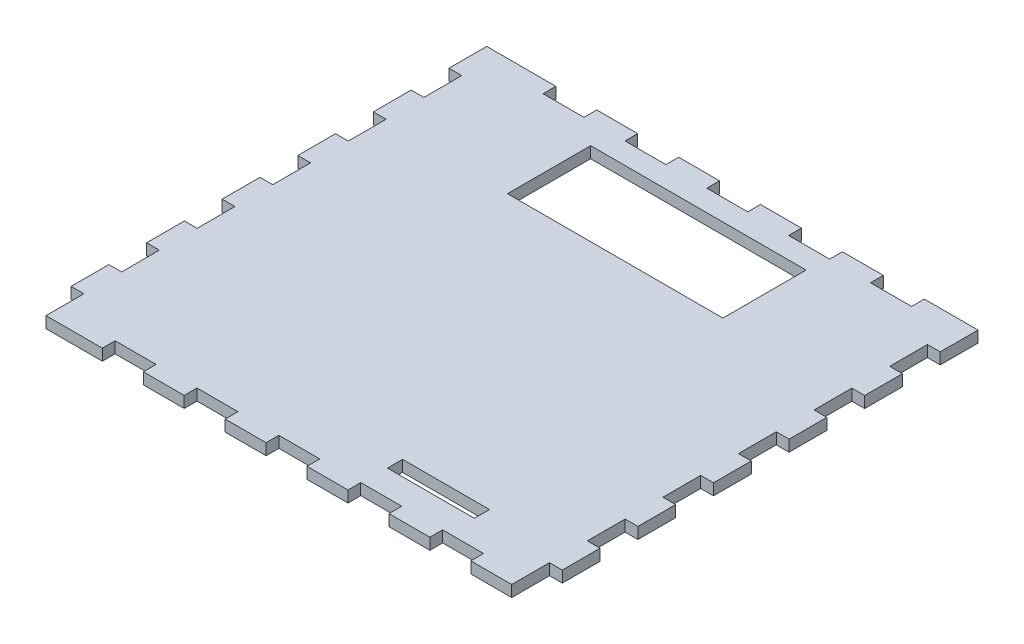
ISO-10303-21;
HEADER;
FILE_DESCRIPTION(('STEP AP214'),'2;1');
FILE_NAME('part.step','',(''),(''),'','','');
FILE_SCHEMA(('AUTOMOTIVE_DESIGN { 1 0 10303 214 1 1 1 1 }'));
ENDSEC;
DATA;
#1=APPLICATION_CONTEXT('core data for automotive mechanical design processes');
#2=APPLICATION_PROTOCOL_DEFINITION('international standard','automotive_design',2000,#1);
#3=PRODUCT_CONTEXT('',#1,'mechanical');
#4=PRODUCT('Part','Part','',(#3));
#5=PRODUCT_RELATED_PRODUCT_CATEGORY('part','',(#4));
#6=PRODUCT_DEFINITION_FORMATION('','',#4);
#7=PRODUCT_DEFINITION_CONTEXT('part definition',#1,'design');
#8=PRODUCT_DEFINITION('design','',#6,#7);
#9=PRODUCT_DEFINITION_SHAPE('','',#8);
#10=(LENGTH_UNIT() NAMED_UNIT(*) SI_UNIT(.MILLI.,.METRE.));
#11=(NAMED_UNIT(*) PLANE_ANGLE_UNIT() SI_UNIT($,.RADIAN.));
#12=(NAMED_UNIT(*) SI_UNIT($,.STERADIAN.) SOLID_ANGLE_UNIT());
#13=UNCERTAINTY_MEASURE_WITH_UNIT(LENGTH_MEASURE(1.E-05),#10,'distance_accuracy_value','');
#14=(GEOMETRIC_REPRESENTATION_CONTEXT(3) GLOBAL_UNCERTAINTY_ASSIGNED_CONTEXT((#13)) GLOBAL_UNIT_ASSIGNED_CONTEXT((#10,
#11,#12)) REPRESENTATION_CONTEXT('',''));
#15=CARTESIAN_POINT('',(0.,0.,0.));
#16=DIRECTION('',(0.,0.,1.));
#17=DIRECTION('',(1.,0.,0.));
#18=AXIS2_PLACEMENT_3D('',#15,#16,#17);
#19=CARTESIAN_POINT('',(-65.,3.,-60.));
#20=DIRECTION('',(0.,0.,1.));
#21=DIRECTION('',(1.,0.,0.));
#22=AXIS2_PLACEMENT_3D('',#19,#20,#21);
#23=PLANE('',#22);
#24=DIRECTION('',(-1.,0.,0.));
#25=VECTOR('',#24,1.);
#26=CARTESIAN_POINT('',(-65.,0.,-60.));
#27=LINE('',#26,#25);
#28=CARTESIAN_POINT('',(-3.37999999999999,0.,-60.));
#29=VERTEX_POINT('',#28);
#30=CARTESIAN_POINT('',(-14.2133333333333,0.,-60.));
#31=VERTEX_POINT('',#30);
#32=EDGE_CURVE('E650',#29,#31,#27,.T.);
#33=ORIENTED_EDGE('',*,*,#32,.T.);
#34=DIRECTION('',(0.,1.,0.));
#35=VECTOR('',#34,1.);
#36=CARTESIAN_POINT('',(-14.2133333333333,0.,-60.));
#37=LINE('',#36,#35);
#38=CARTESIAN_POINT('',(-14.2133333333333,3.,-60.));
#39=VERTEX_POINT('',#38);
#40=EDGE_CURVE('E634',#31,#39,#37,.T.);
#41=ORIENTED_EDGE('',*,*,#40,.T.);
#42=DIRECTION('',(-1.,0.,0.));
#43=VECTOR('',#42,1.);
#44=CARTESIAN_POINT('',(-65.,3.,-60.));
#45=LINE('',#44,#43);
#46=CARTESIAN_POINT('',(-3.37999999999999,3.,-60.));
#47=VERTEX_POINT('',#46);
#48=EDGE_CURVE('E648',#47,#39,#45,.T.);
#49=ORIENTED_EDGE('',*,*,#48,.F.);
#50=DIRECTION('',(0.,1.,0.));
#51=VECTOR('',#50,1.);
#52=CARTESIAN_POINT('',(-3.37999999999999,0.,-60.));
#53=LINE('',#52,#51);
#54=EDGE_CURVE('E1718',#29,#47,#53,.T.);
#55=ORIENTED_EDGE('',*,*,#54,.F.);
#56=EDGE_LOOP('',(#33,#41,#49,#55));
#57=FACE_BOUND('',#56,.T.);
#58=ADVANCED_FACE('F38',(#57),#23,.F.);
#59=CARTESIAN_POINT('',(18.2866666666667,0.,-60.));
#60=VERTEX_POINT('',#59);
#61=CARTESIAN_POINT('',(7.45333333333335,0.,-60.));
#62=VERTEX_POINT('',#61);
#63=EDGE_CURVE('E1746',#60,#62,#27,.T.);
#64=ORIENTED_EDGE('',*,*,#63,.T.);
#65=DIRECTION('',(0.,1.,0.));
#66=VECTOR('',#65,1.);
#67=CARTESIAN_POINT('',(7.45333333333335,0.,-60.));
#68=LINE('',#67,#66);
#69=CARTESIAN_POINT('',(7.45333333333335,3.,-60.));
#70=VERTEX_POINT('',#69);
#71=EDGE_CURVE('E1177',#62,#70,#68,.T.);
#72=ORIENTED_EDGE('',*,*,#71,.T.);
#73=CARTESIAN_POINT('',(18.2866666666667,3.,-60.));
#74=VERTEX_POINT('',#73);
#75=EDGE_CURVE('E658',#74,#70,#45,.T.);
#76=ORIENTED_EDGE('',*,*,#75,.F.);
#77=DIRECTION('',(0.,1.,0.));
#78=VECTOR('',#77,1.);
#79=CARTESIAN_POINT('',(18.2866666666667,0.,-60.));
#80=LINE('',#79,#78);
#81=EDGE_CURVE('E1181',#60,#74,#80,.T.);
#82=ORIENTED_EDGE('',*,*,#81,.F.);
#83=EDGE_LOOP('',(#64,#72,#76,#82));
#84=FACE_BOUND('',#83,.T.);
#85=ADVANCED_FACE('F1415',(#84),#23,.F.);
#86=CARTESIAN_POINT('',(39.9533333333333,0.,-60.));
#87=VERTEX_POINT('',#86);
#88=CARTESIAN_POINT('',(29.12,0.,-60.));
#89=VERTEX_POINT('',#88);
#90=EDGE_CURVE('E688',#87,#89,#27,.T.);
#91=ORIENTED_EDGE('',*,*,#90,.T.);
#92=DIRECTION('',(0.,1.,0.));
#93=VECTOR('',#92,1.);
#94=CARTESIAN_POINT('',(29.12,0.,-60.));
#95=LINE('',#94,#93);
#96=CARTESIAN_POINT('',(29.12,3.,-60.));
#97=VERTEX_POINT('',#96);
#98=EDGE_CURVE('E1157',#89,#97,#95,.T.);
#99=ORIENTED_EDGE('',*,*,#98,.T.);
#100=CARTESIAN_POINT('',(39.9533333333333,3.,-60.));
#101=VERTEX_POINT('',#100);
#102=EDGE_CURVE('E662',#101,#97,#45,.T.);
#103=ORIENTED_EDGE('',*,*,#102,.F.);
#104=DIRECTION('',(0.,1.,0.));
#105=VECTOR('',#104,1.);
#106=CARTESIAN_POINT('',(39.9533333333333,0.,-60.));
#107=LINE('',#106,#105);
#108=EDGE_CURVE('E1155',#87,#101,#107,.T.);
#109=ORIENTED_EDGE('',*,*,#108,.F.);
#110=EDGE_LOOP('',(#91,#99,#103,#109));
#111=FACE_BOUND('',#110,.T.);
#112=ADVANCED_FACE('F1154',(#111),#23,.F.);
#113=CARTESIAN_POINT('',(65.,0.,-60.));
#114=VERTEX_POINT('',#113);
#115=CARTESIAN_POINT('',(50.7866666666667,0.,-60.));
#116=VERTEX_POINT('',#115);
#117=EDGE_CURVE('E684',#114,#116,#27,.T.);
#118=ORIENTED_EDGE('',*,*,#117,.T.);
#119=DIRECTION('',(0.,1.,0.));
#120=VECTOR('',#119,1.);
#121=CARTESIAN_POINT('',(50.7866666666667,0.,-60.));
#122=LINE('',#121,#120);
#123=CARTESIAN_POINT('',(50.7866666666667,3.,-60.));
#124=VERTEX_POINT('',#123);
#125=EDGE_CURVE('E1192',#116,#124,#122,.T.);
#126=ORIENTED_EDGE('',*,*,#125,.T.);
#127=CARTESIAN_POINT('',(65.,3.,-60.));
#128=VERTEX_POINT('',#127);
#129=EDGE_CURVE('E664',#128,#124,#45,.T.);
#130=ORIENTED_EDGE('',*,*,#129,.F.);
#131=DIRECTION('',(0.,-1.,0.));
#132=VECTOR('',#131,1.);
#133=CARTESIAN_POINT('',(65.,3.,-60.));
#134=LINE('',#133,#132);
#135=EDGE_CURVE('E12',#128,#114,#134,.T.);
#136=ORIENTED_EDGE('',*,*,#135,.T.);
#137=EDGE_LOOP('',(#118,#126,#130,#136));
#138=FACE_BOUND('',#137,.T.);
#139=ADVANCED_FACE('F1402',(#138),#23,.F.);
#140=CARTESIAN_POINT('',(0.,3.,0.));
#141=DIRECTION('',(0.,1.,0.));
#142=DIRECTION('',(0.,0.,1.));
#143=AXIS2_PLACEMENT_3D('',#140,#141,#142);
#144=PLANE('',#143);
#145=DIRECTION('',(0.,0.,-1.));
#146=VECTOR('',#145,1.);
#147=CARTESIAN_POINT('',(-14.2133333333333,3.,0.));
#148=LINE('',#147,#146);
#149=CARTESIAN_POINT('',(-14.2133333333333,3.,-56.62));
#150=VERTEX_POINT('',#149);
#151=EDGE_CURVE('E630',#150,#39,#148,.T.);
#152=ORIENTED_EDGE('',*,*,#151,.F.);
#153=DIRECTION('',(1.,0.,0.));
#154=VECTOR('',#153,1.);
#155=CARTESIAN_POINT('',(0.,3.,-56.62));
#156=LINE('',#155,#154);
#157=CARTESIAN_POINT('',(-25.0466666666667,3.,-56.6199999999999));
#158=VERTEX_POINT('',#157);
#159=EDGE_CURVE('E641',#158,#150,#156,.T.);
#160=ORIENTED_EDGE('',*,*,#159,.F.);
#161=DIRECTION('',(0.,0.,1.));
#162=VECTOR('',#161,1.);
#163=CARTESIAN_POINT('',(-25.0466666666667,3.,0.));
#164=LINE('',#163,#162);
#165=CARTESIAN_POINT('',(-25.0466666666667,3.,-60.));
#166=VERTEX_POINT('',#165);
#167=EDGE_CURVE('E1344',#166,#158,#164,.T.);
#168=ORIENTED_EDGE('',*,*,#167,.F.);
#169=CARTESIAN_POINT('',(-35.88,3.,-60.));
#170=VERTEX_POINT('',#169);
#171=EDGE_CURVE('E659',#166,#170,#45,.T.);
#172=ORIENTED_EDGE('',*,*,#171,.T.);
#173=DIRECTION('',(0.,0.,-1.));
#174=VECTOR('',#173,1.);
#175=CARTESIAN_POINT('',(-35.88,3.,0.));
#176=LINE('',#175,#174);
#177=CARTESIAN_POINT('',(-35.88,3.,-56.6199999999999));
#178=VERTEX_POINT('',#177);
#179=EDGE_CURVE('E1335',#178,#170,#176,.T.);
#180=ORIENTED_EDGE('',*,*,#179,.F.);
#181=DIRECTION('',(1.,0.,0.));
#182=VECTOR('',#181,1.);
#183=CARTESIAN_POINT('',(0.,3.,-56.6199999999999));
#184=LINE('',#183,#182);
#185=CARTESIAN_POINT('',(-46.7133333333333,3.,-56.6199999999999));
#186=VERTEX_POINT('',#185);
#187=EDGE_CURVE('E1343',#186,#178,#184,.T.);
#188=ORIENTED_EDGE('',*,*,#187,.F.);
#189=DIRECTION('',(0.,0.,1.));
#190=VECTOR('',#189,1.);
#191=CARTESIAN_POINT('',(-46.7133333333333,3.,0.));
#192=LINE('',#191,#190);
#193=CARTESIAN_POINT('',(-46.7133333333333,3.,-60.));
#194=VERTEX_POINT('',#193);
#195=EDGE_CURVE('E1136',#194,#186,#192,.T.);
#196=ORIENTED_EDGE('',*,*,#195,.F.);
#197=CARTESIAN_POINT('',(-65.,3.,-60.));
#198=VERTEX_POINT('',#197);
#199=EDGE_CURVE('E663',#194,#198,#45,.T.);
#200=ORIENTED_EDGE('',*,*,#199,.T.);
#201=DIRECTION('',(0.,0.,1.));
#202=VECTOR('',#201,1.);
#203=CARTESIAN_POINT('',(-65.,3.,-60.));
#204=LINE('',#203,#202);
#205=CARTESIAN_POINT('',(-65.,3.,-50.));
#206=VERTEX_POINT('',#205);
#207=EDGE_CURVE('E671',#198,#206,#204,.T.);
#208=ORIENTED_EDGE('',*,*,#207,.T.);
#209=DIRECTION('',(1.,0.,0.));
#210=VECTOR('',#209,1.);
#211=CARTESIAN_POINT('',(0.,3.,-50.));
#212=LINE('',#211,#210);
#213=CARTESIAN_POINT('',(-61.62,3.,-50.));
#214=VERTEX_POINT('',#213);
#215=EDGE_CURVE('E735',#206,#214,#212,.T.);
#216=ORIENTED_EDGE('',*,*,#215,.T.);
#217=DIRECTION('',(0.,0.,1.));
#218=VECTOR('',#217,1.);
#219=CARTESIAN_POINT('',(-61.62,3.,0.));
#220=LINE('',#219,#218);
#221=CARTESIAN_POINT('',(-61.62,3.,-40.));
#222=VERTEX_POINT('',#221);
#223=EDGE_CURVE('E731',#214,#222,#220,.T.);
#224=ORIENTED_EDGE('',*,*,#223,.T.);
#225=DIRECTION('',(-1.,0.,0.));
#226=VECTOR('',#225,1.);
#227=CARTESIAN_POINT('',(0.,3.,-40.));
#228=LINE('',#227,#226);
#229=CARTESIAN_POINT('',(-65.,3.,-40.));
#230=VERTEX_POINT('',#229);
#231=EDGE_CURVE('E728',#222,#230,#228,.T.);
#232=ORIENTED_EDGE('',*,*,#231,.T.);
#233=CARTESIAN_POINT('',(-65.,3.,-30.));
#234=VERTEX_POINT('',#233);
#235=EDGE_CURVE('E675',#230,#234,#204,.T.);
#236=ORIENTED_EDGE('',*,*,#235,.T.);
#237=DIRECTION('',(1.,0.,0.));
#238=VECTOR('',#237,1.);
#239=CARTESIAN_POINT('',(0.,3.,-30.));
#240=LINE('',#239,#238);
#241=CARTESIAN_POINT('',(-61.62,3.,-30.));
#242=VERTEX_POINT('',#241);
#243=EDGE_CURVE('E1053',#234,#242,#240,.T.);
#244=ORIENTED_EDGE('',*,*,#243,.T.);
#245=DIRECTION('',(0.,0.,1.));
#246=VECTOR('',#245,1.);
#247=CARTESIAN_POINT('',(-61.62,3.,0.));
#248=LINE('',#247,#246);
#249=CARTESIAN_POINT('',(-61.62,3.,-20.));
#250=VERTEX_POINT('',#249);
#251=EDGE_CURVE('E1060',#242,#250,#248,.T.);
#252=ORIENTED_EDGE('',*,*,#251,.T.);
#253=DIRECTION('',(-1.,0.,0.));
#254=VECTOR('',#253,1.);
#255=CARTESIAN_POINT('',(0.,3.,-20.));
#256=LINE('',#255,#254);
#257=CARTESIAN_POINT('',(-65.,3.,-20.));
#258=VERTEX_POINT('',#257);
#259=EDGE_CURVE('E740',#250,#258,#256,.T.);
#260=ORIENTED_EDGE('',*,*,#259,.T.);
#261=CARTESIAN_POINT('',(-65.,3.,-10.));
#262=VERTEX_POINT('',#261);
#263=EDGE_CURVE('E1125',#258,#262,#204,.T.);
#264=ORIENTED_EDGE('',*,*,#263,.T.);
#265=DIRECTION('',(1.,0.,0.));
#266=VECTOR('',#265,1.);
#267=CARTESIAN_POINT('',(0.,3.,-10.));
#268=LINE('',#267,#266);
#269=CARTESIAN_POINT('',(-61.62,3.,-10.));
#270=VERTEX_POINT('',#269);
#271=EDGE_CURVE('E1029',#262,#270,#268,.T.);
#272=ORIENTED_EDGE('',*,*,#271,.T.);
#273=DIRECTION('',(0.,0.,1.));
#274=VECTOR('',#273,1.);
#275=CARTESIAN_POINT('',(-61.62,3.,0.));
#276=LINE('',#275,#274);
#277=CARTESIAN_POINT('',(-61.62,3.,0.));
#278=VERTEX_POINT('',#277);
#279=EDGE_CURVE('E1037',#270,#278,#276,.T.);
#280=ORIENTED_EDGE('',*,*,#279,.T.);
#281=DIRECTION('',(-1.,0.,0.));
#282=VECTOR('',#281,1.);
#283=CARTESIAN_POINT('',(0.,3.,0.));
#284=LINE('',#283,#282);
#285=CARTESIAN_POINT('',(-65.,3.,0.));
#286=VERTEX_POINT('',#285);
#287=EDGE_CURVE('E1034',#278,#286,#284,.T.);
#288=ORIENTED_EDGE('',*,*,#287,.T.);
#289=CARTESIAN_POINT('',(-65.,3.,9.99999999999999));
#290=VERTEX_POINT('',#289);
#291=EDGE_CURVE('E1122',#286,#290,#204,.T.);
#292=ORIENTED_EDGE('',*,*,#291,.T.);
#293=DIRECTION('',(1.,0.,0.));
#294=VECTOR('',#293,1.);
#295=CARTESIAN_POINT('',(0.,3.,9.99999999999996));
#296=LINE('',#295,#294);
#297=CARTESIAN_POINT('',(-61.62,3.,9.99999999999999));
#298=VERTEX_POINT('',#297);
#299=EDGE_CURVE('E1005',#290,#298,#296,.T.);
#300=ORIENTED_EDGE('',*,*,#299,.T.);
#301=DIRECTION('',(0.,0.,1.));
#302=VECTOR('',#301,1.);
#303=CARTESIAN_POINT('',(-61.62,3.,0.));
#304=LINE('',#303,#302);
#305=CARTESIAN_POINT('',(-61.62,3.,20.));
#306=VERTEX_POINT('',#305);
#307=EDGE_CURVE('E1013',#298,#306,#304,.T.);
#308=ORIENTED_EDGE('',*,*,#307,.T.);
#309=DIRECTION('',(-1.,0.,0.));
#310=VECTOR('',#309,1.);
#311=CARTESIAN_POINT('',(0.,3.,20.));
#312=LINE('',#311,#310);
#313=CARTESIAN_POINT('',(-65.,3.,20.));
#314=VERTEX_POINT('',#313);
#315=EDGE_CURVE('E1010',#306,#314,#312,.T.);
#316=ORIENTED_EDGE('',*,*,#315,.T.);
#317=CARTESIAN_POINT('',(-65.,3.,30.));
#318=VERTEX_POINT('',#317);
#319=EDGE_CURVE('E1120',#314,#318,#204,.T.);
#320=ORIENTED_EDGE('',*,*,#319,.T.);
#321=DIRECTION('',(1.,0.,0.));
#322=VECTOR('',#321,1.);
#323=CARTESIAN_POINT('',(0.,3.,30.));
#324=LINE('',#323,#322);
#325=CARTESIAN_POINT('',(-61.62,3.,30.));
#326=VERTEX_POINT('',#325);
#327=EDGE_CURVE('E981',#318,#326,#324,.T.);
#328=ORIENTED_EDGE('',*,*,#327,.T.);
#329=DIRECTION('',(0.,0.,1.));
#330=VECTOR('',#329,1.);
#331=CARTESIAN_POINT('',(-61.62,3.,0.));
#332=LINE('',#331,#330);
#333=CARTESIAN_POINT('',(-61.62,3.,40.));
#334=VERTEX_POINT('',#333);
#335=EDGE_CURVE('E989',#326,#334,#332,.T.);
#336=ORIENTED_EDGE('',*,*,#335,.T.);
#337=DIRECTION('',(-1.,0.,0.));
#338=VECTOR('',#337,1.);
#339=CARTESIAN_POINT('',(0.,3.,40.));
#340=LINE('',#339,#338);
#341=CARTESIAN_POINT('',(-65.,3.,40.));
#342=VERTEX_POINT('',#341);
#343=EDGE_CURVE('E986',#334,#342,#340,.T.);
#344=ORIENTED_EDGE('',*,*,#343,.T.);
#345=CARTESIAN_POINT('',(-65.,3.,50.));
#346=VERTEX_POINT('',#345);
#347=EDGE_CURVE('E668',#342,#346,#204,.T.);
#348=ORIENTED_EDGE('',*,*,#347,.T.);
#349=DIRECTION('',(1.,0.,0.));
#350=VECTOR('',#349,1.);
#351=CARTESIAN_POINT('',(0.,3.,50.));
#352=LINE('',#351,#350);
#353=CARTESIAN_POINT('',(-61.62,3.,50.));
#354=VERTEX_POINT('',#353);
#355=EDGE_CURVE('E964',#346,#354,#352,.T.);
#356=ORIENTED_EDGE('',*,*,#355,.T.);
#357=DIRECTION('',(0.,0.,1.));
#358=VECTOR('',#357,1.);
#359=CARTESIAN_POINT('',(-61.62,3.,0.));
#360=LINE('',#359,#358);
#361=CARTESIAN_POINT('',(-61.62,3.,60.));
#362=VERTEX_POINT('',#361);
#363=EDGE_CURVE('E967',#354,#362,#360,.T.);
#364=ORIENTED_EDGE('',*,*,#363,.T.);
#365=DIRECTION('',(1.,0.,0.));
#366=VECTOR('',#365,1.);
#367=CARTESIAN_POINT('',(-65.,3.,60.));
#368=LINE('',#367,#366);
#369=CARTESIAN_POINT('',(-46.7133333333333,3.,60.));
#370=VERTEX_POINT('',#369);
#371=EDGE_CURVE('E676',#362,#370,#368,.T.);
#372=ORIENTED_EDGE('',*,*,#371,.T.);
#373=DIRECTION('',(0.,0.,-1.));
#374=VECTOR('',#373,1.);
#375=CARTESIAN_POINT('',(-46.7133333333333,3.,0.));
#376=LINE('',#375,#374);
#377=CARTESIAN_POINT('',(-46.7133333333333,3.,56.62));
#378=VERTEX_POINT('',#377);
#379=EDGE_CURVE('E1294',#370,#378,#376,.T.);
#380=ORIENTED_EDGE('',*,*,#379,.T.);
#381=DIRECTION('',(1.,0.,0.));
#382=VECTOR('',#381,1.);
#383=CARTESIAN_POINT('',(0.,3.,56.62));
#384=LINE('',#383,#382);
#385=CARTESIAN_POINT('',(-35.88,3.,56.62));
#386=VERTEX_POINT('',#385);
#387=EDGE_CURVE('E1319',#378,#386,#384,.T.);
#388=ORIENTED_EDGE('',*,*,#387,.T.);
#389=DIRECTION('',(0.,0.,1.));
#390=VECTOR('',#389,1.);
#391=CARTESIAN_POINT('',(-35.88,3.,0.));
#392=LINE('',#391,#390);
#393=CARTESIAN_POINT('',(-35.88,3.,60.));
#394=VERTEX_POINT('',#393);
#395=EDGE_CURVE('E1322',#386,#394,#392,.T.);
#396=ORIENTED_EDGE('',*,*,#395,.T.);
#397=CARTESIAN_POINT('',(-25.0466666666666,3.,60.));
#398=VERTEX_POINT('',#397);
#399=EDGE_CURVE('E679',#394,#398,#368,.T.);
#400=ORIENTED_EDGE('',*,*,#399,.T.);
#401=DIRECTION('',(0.,0.,-1.));
#402=VECTOR('',#401,1.);
#403=CARTESIAN_POINT('',(-25.0466666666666,3.,0.));
#404=LINE('',#403,#402);
#405=CARTESIAN_POINT('',(-25.0466666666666,3.,56.62));
#406=VERTEX_POINT('',#405);
#407=EDGE_CURVE('E1269',#398,#406,#404,.T.);
#408=ORIENTED_EDGE('',*,*,#407,.T.);
#409=DIRECTION('',(1.,0.,0.));
#410=VECTOR('',#409,1.);
#411=CARTESIAN_POINT('',(0.,3.,56.62));
#412=LINE('',#411,#410);
#413=CARTESIAN_POINT('',(-14.2133333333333,3.,56.62));
#414=VERTEX_POINT('',#413);
#415=EDGE_CURVE('E1295',#406,#414,#412,.T.);
#416=ORIENTED_EDGE('',*,*,#415,.T.);
#417=DIRECTION('',(0.,0.,1.));
#418=VECTOR('',#417,1.);
#419=CARTESIAN_POINT('',(-14.2133333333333,3.,0.));
#420=LINE('',#419,#418);
#421=CARTESIAN_POINT('',(-14.2133333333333,3.,60.));
#422=VERTEX_POINT('',#421);
#423=EDGE_CURVE('E1298',#414,#422,#420,.T.);
#424=ORIENTED_EDGE('',*,*,#423,.T.);
#425=CARTESIAN_POINT('',(-3.37999999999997,3.,60.));
#426=VERTEX_POINT('',#425);
#427=EDGE_CURVE('E2403',#422,#426,#368,.T.);
#428=ORIENTED_EDGE('',*,*,#427,.T.);
#429=DIRECTION('',(0.,0.,-1.));
#430=VECTOR('',#429,1.);
#431=CARTESIAN_POINT('',(-3.37999999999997,3.,0.));
#432=LINE('',#431,#430);
#433=CARTESIAN_POINT('',(-3.37999999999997,3.,56.62));
#434=VERTEX_POINT('',#433);
#435=EDGE_CURVE('E1244',#426,#434,#432,.T.);
#436=ORIENTED_EDGE('',*,*,#435,.T.);
#437=DIRECTION('',(1.,0.,0.));
#438=VECTOR('',#437,1.);
#439=CARTESIAN_POINT('',(0.,3.,56.62));
#440=LINE('',#439,#438);
#441=CARTESIAN_POINT('',(7.45333333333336,3.,56.62));
#442=VERTEX_POINT('',#441);
#443=EDGE_CURVE('E1270',#434,#442,#440,.T.);
#444=ORIENTED_EDGE('',*,*,#443,.T.);
#445=DIRECTION('',(0.,0.,1.));
#446=VECTOR('',#445,1.);
#447=CARTESIAN_POINT('',(7.45333333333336,3.,0.));
#448=LINE('',#447,#446);
#449=CARTESIAN_POINT('',(7.45333333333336,3.,60.));
#450=VERTEX_POINT('',#449);
#451=EDGE_CURVE('E1273',#442,#450,#448,.T.);
#452=ORIENTED_EDGE('',*,*,#451,.T.);
#453=CARTESIAN_POINT('',(18.2866666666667,3.,60.));
#454=VERTEX_POINT('',#453);
#455=EDGE_CURVE('E2404',#450,#454,#368,.T.);
#456=ORIENTED_EDGE('',*,*,#455,.T.);
#457=DIRECTION('',(0.,0.,-1.));
#458=VECTOR('',#457,1.);
#459=CARTESIAN_POINT('',(18.2866666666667,3.,0.));
#460=LINE('',#459,#458);
#461=CARTESIAN_POINT('',(18.2866666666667,3.,56.62));
#462=VERTEX_POINT('',#461);
#463=EDGE_CURVE('E1219',#454,#462,#460,.T.);
#464=ORIENTED_EDGE('',*,*,#463,.T.);
#465=DIRECTION('',(1.,0.,0.));
#466=VECTOR('',#465,1.);
#467=CARTESIAN_POINT('',(0.,3.,56.62));
#468=LINE('',#467,#466);
#469=CARTESIAN_POINT('',(29.12,3.,56.62));
#470=VERTEX_POINT('',#469);
#471=EDGE_CURVE('E1245',#462,#470,#468,.T.);
#472=ORIENTED_EDGE('',*,*,#471,.T.);
#473=DIRECTION('',(0.,0.,1.));
#474=VECTOR('',#473,1.);
#475=CARTESIAN_POINT('',(29.12,3.,0.));
#476=LINE('',#475,#474);
#477=CARTESIAN_POINT('',(29.12,3.,60.));
#478=VERTEX_POINT('',#477);
#479=EDGE_CURVE('E1248',#470,#478,#476,.T.);
#480=ORIENTED_EDGE('',*,*,#479,.T.);
#481=CARTESIAN_POINT('',(39.9533333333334,3.,60.));
#482=VERTEX_POINT('',#481);
#483=EDGE_CURVE('E2406',#478,#482,#368,.T.);
#484=ORIENTED_EDGE('',*,*,#483,.T.);
#485=DIRECTION('',(0.,0.,-1.));
#486=VECTOR('',#485,1.);
#487=CARTESIAN_POINT('',(39.9533333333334,3.,0.));
#488=LINE('',#487,#486);
#489=CARTESIAN_POINT('',(39.9533333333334,3.,56.62));
#490=VERTEX_POINT('',#489);
#491=EDGE_CURVE('E1195',#482,#490,#488,.T.);
#492=ORIENTED_EDGE('',*,*,#491,.T.);
#493=DIRECTION('',(1.,0.,0.));
#494=VECTOR('',#493,1.);
#495=CARTESIAN_POINT('',(0.,3.,56.62));
#496=LINE('',#495,#494);
#497=CARTESIAN_POINT('',(50.7866666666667,3.,56.62));
#498=VERTEX_POINT('',#497);
#499=EDGE_CURVE('E1220',#490,#498,#496,.T.);
#500=ORIENTED_EDGE('',*,*,#499,.T.);
#501=DIRECTION('',(0.,0.,1.));
#502=VECTOR('',#501,1.);
#503=CARTESIAN_POINT('',(50.7866666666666,3.,-1.04261328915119E-13));
#504=LINE('',#503,#502);
#505=CARTESIAN_POINT('',(50.7866666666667,3.,60.));
#506=VERTEX_POINT('',#505);
#507=EDGE_CURVE('E1223',#498,#506,#504,.T.);
#508=ORIENTED_EDGE('',*,*,#507,.T.);
#509=CARTESIAN_POINT('',(61.62,3.,60.));
#510=VERTEX_POINT('',#509);
#511=EDGE_CURVE('E674',#506,#510,#368,.T.);
#512=ORIENTED_EDGE('',*,*,#511,.T.);
#513=DIRECTION('',(0.,0.,1.));
#514=VECTOR('',#513,1.);
#515=CARTESIAN_POINT('',(61.62,3.,0.));
#516=LINE('',#515,#514);
#517=CARTESIAN_POINT('',(61.62,3.,50.));
#518=VERTEX_POINT('',#517);
#519=EDGE_CURVE('E921',#518,#510,#516,.T.);
#520=ORIENTED_EDGE('',*,*,#519,.F.);
#521=DIRECTION('',(-1.,0.,0.));
#522=VECTOR('',#521,1.);
#523=CARTESIAN_POINT('',(2.05292719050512E-13,3.,50.0000000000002));
#524=LINE('',#523,#522);
#525=CARTESIAN_POINT('',(65.,3.,50.));
#526=VERTEX_POINT('',#525);
#527=EDGE_CURVE('E925',#526,#518,#524,.T.);
#528=ORIENTED_EDGE('',*,*,#527,.F.);
#529=DIRECTION('',(0.,0.,-1.));
#530=VECTOR('',#529,1.);
#531=CARTESIAN_POINT('',(65.,3.,-60.));
#532=LINE('',#531,#530);
#533=CARTESIAN_POINT('',(65.,3.,40.));
#534=VERTEX_POINT('',#533);
#535=EDGE_CURVE('E1138',#526,#534,#532,.T.);
#536=ORIENTED_EDGE('',*,*,#535,.T.);
#537=DIRECTION('',(1.,0.,0.));
#538=VECTOR('',#537,1.);
#539=CARTESIAN_POINT('',(1.6423417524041E-13,3.,40.0000000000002));
#540=LINE('',#539,#538);
#541=CARTESIAN_POINT('',(61.62,3.,40.));
#542=VERTEX_POINT('',#541);
#543=EDGE_CURVE('E940',#542,#534,#540,.T.);
#544=ORIENTED_EDGE('',*,*,#543,.F.);
#545=DIRECTION('',(0.,0.,1.));
#546=VECTOR('',#545,1.);
#547=CARTESIAN_POINT('',(61.62,3.,0.));
#548=LINE('',#547,#546);
#549=CARTESIAN_POINT('',(61.62,3.,30.));
#550=VERTEX_POINT('',#549);
#551=EDGE_CURVE('E950',#550,#542,#548,.T.);
#552=ORIENTED_EDGE('',*,*,#551,.F.);
#553=DIRECTION('',(-1.,0.,0.));
#554=VECTOR('',#553,1.);
#555=CARTESIAN_POINT('',(1.23175631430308E-13,3.,30.0000000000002));
#556=LINE('',#555,#554);
#557=CARTESIAN_POINT('',(65.,3.,30.));
#558=VERTEX_POINT('',#557);
#559=EDGE_CURVE('E947',#558,#550,#556,.T.);
#560=ORIENTED_EDGE('',*,*,#559,.F.);
#561=CARTESIAN_POINT('',(65.,3.,20.));
#562=VERTEX_POINT('',#561);
#563=EDGE_CURVE('E1140',#558,#562,#532,.T.);
#564=ORIENTED_EDGE('',*,*,#563,.T.);
#565=DIRECTION('',(1.,0.,0.));
#566=VECTOR('',#565,1.);
#567=CARTESIAN_POINT('',(0.,3.,20.0000000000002));
#568=LINE('',#567,#566);
#569=CARTESIAN_POINT('',(61.62,3.,20.));
#570=VERTEX_POINT('',#569);
#571=EDGE_CURVE('E898',#570,#562,#568,.T.);
#572=ORIENTED_EDGE('',*,*,#571,.F.);
#573=DIRECTION('',(0.,0.,1.));
#574=VECTOR('',#573,1.);
#575=CARTESIAN_POINT('',(61.62,3.,0.));
#576=LINE('',#575,#574);
#577=CARTESIAN_POINT('',(61.62,3.,9.99999999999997));
#578=VERTEX_POINT('',#577);
#579=EDGE_CURVE('E906',#578,#570,#576,.T.);
#580=ORIENTED_EDGE('',*,*,#579,.F.);
#581=DIRECTION('',(-1.,0.,0.));
#582=VECTOR('',#581,1.);
#583=CARTESIAN_POINT('',(0.,3.,10.0000000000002));
#584=LINE('',#583,#582);
#585=CARTESIAN_POINT('',(65.,3.,9.99999999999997));
#586=VERTEX_POINT('',#585);
#587=EDGE_CURVE('E903',#586,#578,#584,.T.);
#588=ORIENTED_EDGE('',*,*,#587,.F.);
#589=CARTESIAN_POINT('',(65.,3.,0.));
#590=VERTEX_POINT('',#589);
#591=EDGE_CURVE('E1390',#586,#590,#532,.T.);
#592=ORIENTED_EDGE('',*,*,#591,.T.);
#593=DIRECTION('',(1.,0.,0.));
#594=VECTOR('',#593,1.);
#595=CARTESIAN_POINT('',(0.,3.,0.));
#596=LINE('',#595,#594);
#597=CARTESIAN_POINT('',(61.62,3.,0.));
#598=VERTEX_POINT('',#597);
#599=EDGE_CURVE('E889',#598,#590,#596,.T.);
#600=ORIENTED_EDGE('',*,*,#599,.F.);
#601=DIRECTION('',(0.,0.,1.));
#602=VECTOR('',#601,1.);
#603=CARTESIAN_POINT('',(61.62,3.,0.));
#604=LINE('',#603,#602);
#605=CARTESIAN_POINT('',(61.62,3.,-10.));
#606=VERTEX_POINT('',#605);
#607=EDGE_CURVE('E885',#606,#598,#604,.T.);
#608=ORIENTED_EDGE('',*,*,#607,.F.);
#609=DIRECTION('',(-1.,0.,0.));
#610=VECTOR('',#609,1.);
#611=CARTESIAN_POINT('',(0.,3.,-10.0000000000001));
#612=LINE('',#611,#610);
#613=CARTESIAN_POINT('',(65.,3.,-10.));
#614=VERTEX_POINT('',#613);
#615=EDGE_CURVE('E882',#614,#606,#612,.T.);
#616=ORIENTED_EDGE('',*,*,#615,.F.);
#617=CARTESIAN_POINT('',(65.,3.,-20.));
#618=VERTEX_POINT('',#617);
#619=EDGE_CURVE('E669',#614,#618,#532,.T.);
#620=ORIENTED_EDGE('',*,*,#619,.T.);
#621=DIRECTION('',(1.,0.,0.));
#622=VECTOR('',#621,1.);
#623=CARTESIAN_POINT('',(0.,3.,-20.));
#624=LINE('',#623,#622);
#625=CARTESIAN_POINT('',(61.62,3.,-20.));
#626=VERTEX_POINT('',#625);
#627=EDGE_CURVE('E748',#626,#618,#624,.T.);
#628=ORIENTED_EDGE('',*,*,#627,.F.);
#629=DIRECTION('',(0.,0.,1.));
#630=VECTOR('',#629,1.);
#631=CARTESIAN_POINT('',(61.62,3.,0.));
#632=LINE('',#631,#630);
#633=CARTESIAN_POINT('',(61.62,3.,-30.));
#634=VERTEX_POINT('',#633);
#635=EDGE_CURVE('E758',#634,#626,#632,.T.);
#636=ORIENTED_EDGE('',*,*,#635,.F.);
#637=DIRECTION('',(-1.,0.,0.));
#638=VECTOR('',#637,1.);
#639=CARTESIAN_POINT('',(0.,3.,-30.));
#640=LINE('',#639,#638);
#641=CARTESIAN_POINT('',(65.,3.,-30.));
#642=VERTEX_POINT('',#641);
#643=EDGE_CURVE('E755',#642,#634,#640,.T.);
#644=ORIENTED_EDGE('',*,*,#643,.F.);
#645=CARTESIAN_POINT('',(65.,3.,-40.));
#646=VERTEX_POINT('',#645);
#647=EDGE_CURVE('E1391',#642,#646,#532,.T.);
#648=ORIENTED_EDGE('',*,*,#647,.T.);
#649=DIRECTION('',(1.,0.,0.));
#650=VECTOR('',#649,1.);
#651=CARTESIAN_POINT('',(0.,3.,-40.));
#652=LINE('',#651,#650);
#653=CARTESIAN_POINT('',(61.62,3.,-40.));
#654=VERTEX_POINT('',#653);
#655=EDGE_CURVE('E1360',#654,#646,#652,.T.);
#656=ORIENTED_EDGE('',*,*,#655,.F.);
#657=DIRECTION('',(0.,0.,1.));
#658=VECTOR('',#657,1.);
#659=CARTESIAN_POINT('',(61.62,3.,0.));
#660=LINE('',#659,#658);
#661=CARTESIAN_POINT('',(61.62,3.,-50.));
#662=VERTEX_POINT('',#661);
#663=EDGE_CURVE('E1369',#662,#654,#660,.T.);
#664=ORIENTED_EDGE('',*,*,#663,.F.);
#665=DIRECTION('',(-1.,0.,0.));
#666=VECTOR('',#665,1.);
#667=CARTESIAN_POINT('',(0.,3.,-50.));
#668=LINE('',#667,#666);
#669=CARTESIAN_POINT('',(65.,3.,-50.));
#670=VERTEX_POINT('',#669);
#671=EDGE_CURVE('E892',#670,#662,#668,.T.);
#672=ORIENTED_EDGE('',*,*,#671,.F.);
#673=EDGE_CURVE('E698',#670,#128,#532,.T.);
#674=ORIENTED_EDGE('',*,*,#673,.T.);
#675=ORIENTED_EDGE('',*,*,#129,.T.);
#676=DIRECTION('',(0.,0.,-1.));
#677=VECTOR('',#676,1.);
#678=CARTESIAN_POINT('',(50.7866666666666,3.,1.04261328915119E-13));
#679=LINE('',#678,#677);
#680=CARTESIAN_POINT('',(50.7866666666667,3.,-56.62));
#681=VERTEX_POINT('',#680);
#682=EDGE_CURVE('E1196',#681,#124,#679,.T.);
#683=ORIENTED_EDGE('',*,*,#682,.F.);
#684=DIRECTION('',(1.,0.,0.));
#685=VECTOR('',#684,1.);
#686=CARTESIAN_POINT('',(0.,3.,-56.62));
#687=LINE('',#686,#685);
#688=CARTESIAN_POINT('',(39.9533333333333,3.,-56.62));
#689=VERTEX_POINT('',#688);
#690=EDGE_CURVE('E1165',#689,#681,#687,.T.);
#691=ORIENTED_EDGE('',*,*,#690,.F.);
#692=DIRECTION('',(0.,0.,1.));
#693=VECTOR('',#692,1.);
#694=CARTESIAN_POINT('',(39.9533333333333,3.,0.));
#695=LINE('',#694,#693);
#696=EDGE_CURVE('E1149',#101,#689,#695,.T.);
#697=ORIENTED_EDGE('',*,*,#696,.F.);
#698=ORIENTED_EDGE('',*,*,#102,.T.);
#699=DIRECTION('',(0.,0.,-1.));
#700=VECTOR('',#699,1.);
#701=CARTESIAN_POINT('',(29.12,3.,0.));
#702=LINE('',#701,#700);
#703=CARTESIAN_POINT('',(29.12,3.,-56.62));
#704=VERTEX_POINT('',#703);
#705=EDGE_CURVE('E1146',#704,#97,#702,.T.);
#706=ORIENTED_EDGE('',*,*,#705,.F.);
#707=DIRECTION('',(1.,0.,0.));
#708=VECTOR('',#707,1.);
#709=CARTESIAN_POINT('',(0.,3.,-56.62));
#710=LINE('',#709,#708);
#711=CARTESIAN_POINT('',(18.2866666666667,3.,-56.62));
#712=VERTEX_POINT('',#711);
#713=EDGE_CURVE('E1170',#712,#704,#710,.T.);
#714=ORIENTED_EDGE('',*,*,#713,.F.);
#715=DIRECTION('',(0.,0.,1.));
#716=VECTOR('',#715,1.);
#717=CARTESIAN_POINT('',(18.2866666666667,3.,0.));
#718=LINE('',#717,#716);
#719=EDGE_CURVE('E1174',#74,#712,#718,.T.);
#720=ORIENTED_EDGE('',*,*,#719,.F.);
#721=ORIENTED_EDGE('',*,*,#75,.T.);
#722=DIRECTION('',(0.,0.,-1.));
#723=VECTOR('',#722,1.);
#724=CARTESIAN_POINT('',(7.45333333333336,3.,0.));
#725=LINE('',#724,#723);
#726=CARTESIAN_POINT('',(7.45333333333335,3.,-56.62));
#727=VERTEX_POINT('',#726);
#728=EDGE_CURVE('E1727',#727,#70,#725,.T.);
#729=ORIENTED_EDGE('',*,*,#728,.F.);
#730=DIRECTION('',(1.,0.,0.));
#731=VECTOR('',#730,1.);
#732=CARTESIAN_POINT('',(0.,3.,-56.62));
#733=LINE('',#732,#731);
#734=CARTESIAN_POINT('',(-3.37999999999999,3.,-56.62));
#735=VERTEX_POINT('',#734);
#736=EDGE_CURVE('E1729',#735,#727,#733,.T.);
#737=ORIENTED_EDGE('',*,*,#736,.F.);
#738=DIRECTION('',(0.,0.,1.));
#739=VECTOR('',#738,1.);
#740=CARTESIAN_POINT('',(-3.37999999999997,3.,0.));
#741=LINE('',#740,#739);
#742=EDGE_CURVE('E651',#47,#735,#741,.T.);
#743=ORIENTED_EDGE('',*,*,#742,.F.);
#744=ORIENTED_EDGE('',*,*,#48,.T.);
#745=EDGE_LOOP('',(#152,#160,#168,#172,#180,#188,#196,#200,#208,#216,#224,#232,#236,#244,#252,
#260,#264,#272,#280,#288,#292,#300,#308,#316,#320,#328,#336,#344,#348,#356,#364,#372,#380,#388,
#396,#400,#408,#416,#424,#428,#436,#444,#452,#456,#464,#472,#480,#484,#492,#500,#508,#512,#520,
#528,#536,#544,#552,#560,#564,#572,#580,#588,#592,#600,#608,#616,#620,#628,#636,#644,#648,#656,
#664,#672,#674,#675,#683,#691,#697,#698,#706,#714,#720,#721,#729,#737,#743,#744));
#746=FACE_BOUND('',#745,.T.);
#747=DIRECTION('',(0.,0.,-1.));
#748=VECTOR('',#747,1.);
#749=CARTESIAN_POINT('',(28.5,3.,-51.));
#750=LINE('',#749,#748);
#751=CARTESIAN_POINT('',(28.5,3.,-29.));
#752=VERTEX_POINT('',#751);
#753=CARTESIAN_POINT('',(28.5,3.,-51.));
#754=VERTEX_POINT('',#753);
#755=EDGE_CURVE('E767',#752,#754,#750,.T.);
#756=ORIENTED_EDGE('',*,*,#755,.F.);
#757=DIRECTION('',(1.,0.,0.));
#758=VECTOR('',#757,1.);
#759=CARTESIAN_POINT('',(-28.5,3.,-29.));
#760=LINE('',#759,#758);
#761=CARTESIAN_POINT('',(-28.5,3.,-29.));
#762=VERTEX_POINT('',#761);
#763=EDGE_CURVE('E777',#762,#752,#760,.T.);
#764=ORIENTED_EDGE('',*,*,#763,.F.);
#765=DIRECTION('',(0.,0.,1.));
#766=VECTOR('',#765,1.);
#767=CARTESIAN_POINT('',(-28.5,3.,-51.));
#768=LINE('',#767,#766);
#769=CARTESIAN_POINT('',(-28.5,3.,-51.));
#770=VERTEX_POINT('',#769);
#771=EDGE_CURVE('E791',#770,#762,#768,.T.);
#772=ORIENTED_EDGE('',*,*,#771,.F.);
#773=DIRECTION('',(-1.,0.,0.));
#774=VECTOR('',#773,1.);
#775=CARTESIAN_POINT('',(-28.5,3.,-51.));
#776=LINE('',#775,#774);
#777=EDGE_CURVE('E788',#754,#770,#776,.T.);
#778=ORIENTED_EDGE('',*,*,#777,.F.);
#779=EDGE_LOOP('',(#756,#764,#772,#778));
#780=FACE_BOUND('',#779,.T.);
#781=DIRECTION('',(-1.,0.,0.));
#782=VECTOR('',#781,1.);
#783=CARTESIAN_POINT('',(18.5,3.,45.7641509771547));
#784=LINE('',#783,#782);
#785=CARTESIAN_POINT('',(41.5,3.,45.7641509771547));
#786=VERTEX_POINT('',#785);
#787=CARTESIAN_POINT('',(18.5,3.,45.7641509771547));
#788=VERTEX_POINT('',#787);
#789=EDGE_CURVE('E807',#786,#788,#784,.T.);
#790=ORIENTED_EDGE('',*,*,#789,.F.);
#791=DIRECTION('',(0.,0.,-1.));
#792=VECTOR('',#791,1.);
#793=CARTESIAN_POINT('',(41.5,3.,45.7641509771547));
#794=LINE('',#793,#792);
#795=CARTESIAN_POINT('',(41.5,3.,49.7641509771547));
#796=VERTEX_POINT('',#795);
#797=EDGE_CURVE('E805',#796,#786,#794,.T.);
#798=ORIENTED_EDGE('',*,*,#797,.F.);
#799=DIRECTION('',(1.,0.,0.));
#800=VECTOR('',#799,1.);
#801=CARTESIAN_POINT('',(18.5,3.,49.7641509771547));
#802=LINE('',#801,#800);
#803=CARTESIAN_POINT('',(18.5,3.,49.7641509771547));
#804=VERTEX_POINT('',#803);
#805=EDGE_CURVE('E813',#804,#796,#802,.T.);
#806=ORIENTED_EDGE('',*,*,#805,.F.);
#807=DIRECTION('',(0.,0.,1.));
#808=VECTOR('',#807,1.);
#809=CARTESIAN_POINT('',(18.5,3.,45.7641509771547));
#810=LINE('',#809,#808);
#811=EDGE_CURVE('E810',#788,#804,#810,.T.);
#812=ORIENTED_EDGE('',*,*,#811,.F.);
#813=EDGE_LOOP('',(#790,#798,#806,#812));
#814=FACE_BOUND('',#813,.T.);
#815=ADVANCED_FACE('F654',(#746,#780,#814),#144,.T.);
#816=CARTESIAN_POINT('',(0.,0.,0.));
#817=DIRECTION('',(0.,1.,0.));
#818=DIRECTION('',(0.,0.,1.));
#819=AXIS2_PLACEMENT_3D('',#816,#817,#818);
#820=PLANE('',#819);
#821=DIRECTION('',(0.,0.,-1.));
#822=VECTOR('',#821,1.);
#823=CARTESIAN_POINT('',(41.5,0.,45.7641509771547));
#824=LINE('',#823,#822);
#825=CARTESIAN_POINT('',(41.5,0.,49.7641509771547));
#826=VERTEX_POINT('',#825);
#827=CARTESIAN_POINT('',(41.5,0.,45.7641509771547));
#828=VERTEX_POINT('',#827);
#829=EDGE_CURVE('E798',#826,#828,#824,.T.);
#830=ORIENTED_EDGE('',*,*,#829,.T.);
#831=DIRECTION('',(-1.,0.,0.));
#832=VECTOR('',#831,1.);
#833=CARTESIAN_POINT('',(18.5,0.,45.7641509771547));
#834=LINE('',#833,#832);
#835=CARTESIAN_POINT('',(18.5,0.,45.7641509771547));
#836=VERTEX_POINT('',#835);
#837=EDGE_CURVE('E818',#828,#836,#834,.T.);
#838=ORIENTED_EDGE('',*,*,#837,.T.);
#839=DIRECTION('',(0.,0.,1.));
#840=VECTOR('',#839,1.);
#841=CARTESIAN_POINT('',(18.5,0.,45.7641509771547));
#842=LINE('',#841,#840);
#843=CARTESIAN_POINT('',(18.5,0.,49.7641509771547));
#844=VERTEX_POINT('',#843);
#845=EDGE_CURVE('E821',#836,#844,#842,.T.);
#846=ORIENTED_EDGE('',*,*,#845,.T.);
#847=DIRECTION('',(1.,0.,0.));
#848=VECTOR('',#847,1.);
#849=CARTESIAN_POINT('',(18.5,0.,49.7641509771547));
#850=LINE('',#849,#848);
#851=EDGE_CURVE('E808',#844,#826,#850,.T.);
#852=ORIENTED_EDGE('',*,*,#851,.T.);
#853=EDGE_LOOP('',(#830,#838,#846,#852));
#854=FACE_BOUND('',#853,.T.);
#855=DIRECTION('',(1.,0.,0.));
#856=VECTOR('',#855,1.);
#857=CARTESIAN_POINT('',(-28.5,0.,-29.));
#858=LINE('',#857,#856);
#859=CARTESIAN_POINT('',(-28.5,0.,-29.));
#860=VERTEX_POINT('',#859);
#861=CARTESIAN_POINT('',(28.5,0.,-29.));
#862=VERTEX_POINT('',#861);
#863=EDGE_CURVE('E783',#860,#862,#858,.T.);
#864=ORIENTED_EDGE('',*,*,#863,.T.);
#865=DIRECTION('',(0.,0.,-1.));
#866=VECTOR('',#865,1.);
#867=CARTESIAN_POINT('',(28.5,0.,-51.));
#868=LINE('',#867,#866);
#869=CARTESIAN_POINT('',(28.5,0.,-51.));
#870=VERTEX_POINT('',#869);
#871=EDGE_CURVE('E773',#862,#870,#868,.T.);
#872=ORIENTED_EDGE('',*,*,#871,.T.);
#873=DIRECTION('',(-1.,0.,0.));
#874=VECTOR('',#873,1.);
#875=CARTESIAN_POINT('',(-28.5,0.,-51.));
#876=LINE('',#875,#874);
#877=CARTESIAN_POINT('',(-28.5,0.,-51.));
#878=VERTEX_POINT('',#877);
#879=EDGE_CURVE('E776',#870,#878,#876,.T.);
#880=ORIENTED_EDGE('',*,*,#879,.T.);
#881=DIRECTION('',(0.,0.,1.));
#882=VECTOR('',#881,1.);
#883=CARTESIAN_POINT('',(-28.5,0.,-51.));
#884=LINE('',#883,#882);
#885=EDGE_CURVE('E780',#878,#860,#884,.T.);
#886=ORIENTED_EDGE('',*,*,#885,.T.);
#887=EDGE_LOOP('',(#864,#872,#880,#886));
#888=FACE_BOUND('',#887,.T.);
#889=DIRECTION('',(1.,0.,0.));
#890=VECTOR('',#889,1.);
#891=CARTESIAN_POINT('',(0.,0.,-56.62));
#892=LINE('',#891,#890);
#893=CARTESIAN_POINT('',(-25.0466666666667,0.,-56.6199999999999));
#894=VERTEX_POINT('',#893);
#895=CARTESIAN_POINT('',(-14.2133333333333,0.,-56.62));
#896=VERTEX_POINT('',#895);
#897=EDGE_CURVE('E53',#894,#896,#892,.T.);
#898=ORIENTED_EDGE('',*,*,#897,.T.);
#899=DIRECTION('',(0.,0.,-1.));
#900=VECTOR('',#899,1.);
#901=CARTESIAN_POINT('',(-14.2133333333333,0.,0.));
#902=LINE('',#901,#900);
#903=EDGE_CURVE('E1714',#896,#31,#902,.T.);
#904=ORIENTED_EDGE('',*,*,#903,.T.);
#905=ORIENTED_EDGE('',*,*,#32,.F.);
#906=DIRECTION('',(0.,0.,1.));
#907=VECTOR('',#906,1.);
#908=CARTESIAN_POINT('',(-3.37999999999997,0.,0.));
#909=LINE('',#908,#907);
#910=CARTESIAN_POINT('',(-3.37999999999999,0.,-56.62));
#911=VERTEX_POINT('',#910);
#912=EDGE_CURVE('E1730',#29,#911,#909,.T.);
#913=ORIENTED_EDGE('',*,*,#912,.T.);
#914=DIRECTION('',(1.,0.,0.));
#915=VECTOR('',#914,1.);
#916=CARTESIAN_POINT('',(0.,0.,-56.62));
#917=LINE('',#916,#915);
#918=CARTESIAN_POINT('',(7.45333333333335,0.,-56.62));
#919=VERTEX_POINT('',#918);
#920=EDGE_CURVE('E61',#911,#919,#917,.T.);
#921=ORIENTED_EDGE('',*,*,#920,.T.);
#922=DIRECTION('',(0.,0.,-1.));
#923=VECTOR('',#922,1.);
#924=CARTESIAN_POINT('',(7.45333333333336,0.,0.));
#925=LINE('',#924,#923);
#926=EDGE_CURVE('E1720',#919,#62,#925,.T.);
#927=ORIENTED_EDGE('',*,*,#926,.T.);
#928=ORIENTED_EDGE('',*,*,#63,.F.);
#929=DIRECTION('',(0.,0.,1.));
#930=VECTOR('',#929,1.);
#931=CARTESIAN_POINT('',(18.2866666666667,0.,0.));
#932=LINE('',#931,#930);
#933=CARTESIAN_POINT('',(18.2866666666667,0.,-56.62));
#934=VERTEX_POINT('',#933);
#935=EDGE_CURVE('E1171',#60,#934,#932,.T.);
#936=ORIENTED_EDGE('',*,*,#935,.T.);
#937=DIRECTION('',(1.,0.,0.));
#938=VECTOR('',#937,1.);
#939=CARTESIAN_POINT('',(0.,0.,-56.62));
#940=LINE('',#939,#938);
#941=CARTESIAN_POINT('',(29.12,0.,-56.62));
#942=VERTEX_POINT('',#941);
#943=EDGE_CURVE('E1180',#934,#942,#940,.T.);
#944=ORIENTED_EDGE('',*,*,#943,.T.);
#945=DIRECTION('',(0.,0.,-1.));
#946=VECTOR('',#945,1.);
#947=CARTESIAN_POINT('',(29.12,0.,0.));
#948=LINE('',#947,#946);
#949=EDGE_CURVE('E1178',#942,#89,#948,.T.);
#950=ORIENTED_EDGE('',*,*,#949,.T.);
#951=ORIENTED_EDGE('',*,*,#90,.F.);
#952=DIRECTION('',(0.,0.,1.));
#953=VECTOR('',#952,1.);
#954=CARTESIAN_POINT('',(39.9533333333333,0.,0.));
#955=LINE('',#954,#953);
#956=CARTESIAN_POINT('',(39.9533333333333,0.,-56.62));
#957=VERTEX_POINT('',#956);
#958=EDGE_CURVE('E1198',#87,#957,#955,.T.);
#959=ORIENTED_EDGE('',*,*,#958,.T.);
#960=DIRECTION('',(1.,0.,0.));
#961=VECTOR('',#960,1.);
#962=CARTESIAN_POINT('',(0.,0.,-56.62));
#963=LINE('',#962,#961);
#964=CARTESIAN_POINT('',(50.7866666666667,0.,-56.62));
#965=VERTEX_POINT('',#964);
#966=EDGE_CURVE('E1203',#957,#965,#963,.T.);
#967=ORIENTED_EDGE('',*,*,#966,.T.);
#968=DIRECTION('',(0.,0.,-1.));
#969=VECTOR('',#968,1.);
#970=CARTESIAN_POINT('',(50.7866666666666,0.,1.04261328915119E-13));
#971=LINE('',#970,#969);
#972=EDGE_CURVE('E1187',#965,#116,#971,.T.);
#973=ORIENTED_EDGE('',*,*,#972,.T.);
#974=ORIENTED_EDGE('',*,*,#117,.F.);
#975=DIRECTION('',(0.,0.,-1.));
#976=VECTOR('',#975,1.);
#977=CARTESIAN_POINT('',(65.,0.,-60.));
#978=LINE('',#977,#976);
#979=CARTESIAN_POINT('',(65.,0.,-50.));
#980=VERTEX_POINT('',#979);
#981=EDGE_CURVE('E833',#980,#114,#978,.T.);
#982=ORIENTED_EDGE('',*,*,#981,.F.);
#983=DIRECTION('',(-1.,0.,0.));
#984=VECTOR('',#983,1.);
#985=CARTESIAN_POINT('',(0.,0.,-50.));
#986=LINE('',#985,#984);
#987=CARTESIAN_POINT('',(61.62,0.,-50.));
#988=VERTEX_POINT('',#987);
#989=EDGE_CURVE('E1356',#980,#988,#986,.T.);
#990=ORIENTED_EDGE('',*,*,#989,.T.);
#991=DIRECTION('',(0.,0.,1.));
#992=VECTOR('',#991,1.);
#993=CARTESIAN_POINT('',(61.62,0.,0.));
#994=LINE('',#993,#992);
#995=CARTESIAN_POINT('',(61.62,0.,-40.));
#996=VERTEX_POINT('',#995);
#997=EDGE_CURVE('E1359',#988,#996,#994,.T.);
#998=ORIENTED_EDGE('',*,*,#997,.T.);
#999=DIRECTION('',(1.,0.,0.));
#1000=VECTOR('',#999,1.);
#1001=CARTESIAN_POINT('',(0.,0.,-40.));
#1002=LINE('',#1001,#1000);
#1003=CARTESIAN_POINT('',(65.,0.,-40.));
#1004=VERTEX_POINT('',#1003);
#1005=EDGE_CURVE('E1363',#996,#1004,#1002,.T.);
#1006=ORIENTED_EDGE('',*,*,#1005,.T.);
#1007=CARTESIAN_POINT('',(65.,0.,-30.));
#1008=VERTEX_POINT('',#1007);
#1009=EDGE_CURVE('E683',#1008,#1004,#978,.T.);
#1010=ORIENTED_EDGE('',*,*,#1009,.F.);
#1011=DIRECTION('',(-1.,0.,0.));
#1012=VECTOR('',#1011,1.);
#1013=CARTESIAN_POINT('',(0.,0.,-30.));
#1014=LINE('',#1013,#1012);
#1015=CARTESIAN_POINT('',(61.62,0.,-30.));
#1016=VERTEX_POINT('',#1015);
#1017=EDGE_CURVE('E744',#1008,#1016,#1014,.T.);
#1018=ORIENTED_EDGE('',*,*,#1017,.T.);
#1019=DIRECTION('',(0.,0.,1.));
#1020=VECTOR('',#1019,1.);
#1021=CARTESIAN_POINT('',(61.62,0.,0.));
#1022=LINE('',#1021,#1020);
#1023=CARTESIAN_POINT('',(61.62,0.,-20.));
#1024=VERTEX_POINT('',#1023);
#1025=EDGE_CURVE('E747',#1016,#1024,#1022,.T.);
#1026=ORIENTED_EDGE('',*,*,#1025,.T.);
#1027=DIRECTION('',(1.,0.,0.));
#1028=VECTOR('',#1027,1.);
#1029=CARTESIAN_POINT('',(0.,0.,-20.));
#1030=LINE('',#1029,#1028);
#1031=CARTESIAN_POINT('',(65.,0.,-20.));
#1032=VERTEX_POINT('',#1031);
#1033=EDGE_CURVE('E751',#1024,#1032,#1030,.T.);
#1034=ORIENTED_EDGE('',*,*,#1033,.T.);
#1035=CARTESIAN_POINT('',(65.,0.,-10.));
#1036=VERTEX_POINT('',#1035);
#1037=EDGE_CURVE('E680',#1036,#1032,#978,.T.);
#1038=ORIENTED_EDGE('',*,*,#1037,.F.);
#1039=DIRECTION('',(-1.,0.,0.));
#1040=VECTOR('',#1039,1.);
#1041=CARTESIAN_POINT('',(0.,0.,-10.0000000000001));
#1042=LINE('',#1041,#1040);
#1043=CARTESIAN_POINT('',(61.62,0.,-10.));
#1044=VERTEX_POINT('',#1043);
#1045=EDGE_CURVE('E878',#1036,#1044,#1042,.T.);
#1046=ORIENTED_EDGE('',*,*,#1045,.T.);
#1047=DIRECTION('',(0.,0.,1.));
#1048=VECTOR('',#1047,1.);
#1049=CARTESIAN_POINT('',(61.62,0.,0.));
#1050=LINE('',#1049,#1048);
#1051=CARTESIAN_POINT('',(61.62,0.,0.));
#1052=VERTEX_POINT('',#1051);
#1053=EDGE_CURVE('E872',#1044,#1052,#1050,.T.);
#1054=ORIENTED_EDGE('',*,*,#1053,.T.);
#1055=DIRECTION('',(1.,0.,0.));
#1056=VECTOR('',#1055,1.);
#1057=CARTESIAN_POINT('',(0.,0.,0.));
#1058=LINE('',#1057,#1056);
#1059=CARTESIAN_POINT('',(65.,0.,0.));
#1060=VERTEX_POINT('',#1059);
#1061=EDGE_CURVE('E870',#1052,#1060,#1058,.T.);
#1062=ORIENTED_EDGE('',*,*,#1061,.T.);
#1063=CARTESIAN_POINT('',(65.,0.,9.99999999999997));
#1064=VERTEX_POINT('',#1063);
#1065=EDGE_CURVE('E682',#1064,#1060,#978,.T.);
#1066=ORIENTED_EDGE('',*,*,#1065,.F.);
#1067=DIRECTION('',(-1.,0.,0.));
#1068=VECTOR('',#1067,1.);
#1069=CARTESIAN_POINT('',(0.,0.,10.0000000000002));
#1070=LINE('',#1069,#1068);
#1071=CARTESIAN_POINT('',(61.62,0.,9.99999999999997));
#1072=VERTEX_POINT('',#1071);
#1073=EDGE_CURVE('E867',#1064,#1072,#1070,.T.);
#1074=ORIENTED_EDGE('',*,*,#1073,.T.);
#1075=DIRECTION('',(0.,0.,1.));
#1076=VECTOR('',#1075,1.);
#1077=CARTESIAN_POINT('',(61.62,0.,0.));
#1078=LINE('',#1077,#1076);
#1079=CARTESIAN_POINT('',(61.62,0.,20.));
#1080=VERTEX_POINT('',#1079);
#1081=EDGE_CURVE('E897',#1072,#1080,#1078,.T.);
#1082=ORIENTED_EDGE('',*,*,#1081,.T.);
#1083=DIRECTION('',(1.,0.,0.));
#1084=VECTOR('',#1083,1.);
#1085=CARTESIAN_POINT('',(0.,0.,20.0000000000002));
#1086=LINE('',#1085,#1084);
#1087=CARTESIAN_POINT('',(65.,0.,20.));
#1088=VERTEX_POINT('',#1087);
#1089=EDGE_CURVE('E900',#1080,#1088,#1086,.T.);
#1090=ORIENTED_EDGE('',*,*,#1089,.T.);
#1091=CARTESIAN_POINT('',(65.,0.,30.));
#1092=VERTEX_POINT('',#1091);
#1093=EDGE_CURVE('E844',#1092,#1088,#978,.T.);
#1094=ORIENTED_EDGE('',*,*,#1093,.F.);
#1095=DIRECTION('',(-1.,0.,0.));
#1096=VECTOR('',#1095,1.);
#1097=CARTESIAN_POINT('',(1.23175631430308E-13,0.,30.0000000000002));
#1098=LINE('',#1097,#1096);
#1099=CARTESIAN_POINT('',(61.62,0.,30.));
#1100=VERTEX_POINT('',#1099);
#1101=EDGE_CURVE('E936',#1092,#1100,#1098,.T.);
#1102=ORIENTED_EDGE('',*,*,#1101,.T.);
#1103=DIRECTION('',(0.,0.,1.));
#1104=VECTOR('',#1103,1.);
#1105=CARTESIAN_POINT('',(61.62,0.,0.));
#1106=LINE('',#1105,#1104);
#1107=CARTESIAN_POINT('',(61.62,0.,40.));
#1108=VERTEX_POINT('',#1107);
#1109=EDGE_CURVE('E939',#1100,#1108,#1106,.T.);
#1110=ORIENTED_EDGE('',*,*,#1109,.T.);
#1111=DIRECTION('',(1.,0.,0.));
#1112=VECTOR('',#1111,1.);
#1113=CARTESIAN_POINT('',(1.6423417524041E-13,0.,40.0000000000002));
#1114=LINE('',#1113,#1112);
#1115=CARTESIAN_POINT('',(65.,0.,40.));
#1116=VERTEX_POINT('',#1115);
#1117=EDGE_CURVE('E943',#1108,#1116,#1114,.T.);
#1118=ORIENTED_EDGE('',*,*,#1117,.T.);
#1119=CARTESIAN_POINT('',(65.,0.,50.));
#1120=VERTEX_POINT('',#1119);
#1121=EDGE_CURVE('E836',#1120,#1116,#978,.T.);
#1122=ORIENTED_EDGE('',*,*,#1121,.F.);
#1123=DIRECTION('',(-1.,0.,0.));
#1124=VECTOR('',#1123,1.);
#1125=CARTESIAN_POINT('',(2.05292719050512E-13,0.,50.0000000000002));
#1126=LINE('',#1125,#1124);
#1127=CARTESIAN_POINT('',(61.62,0.,50.));
#1128=VERTEX_POINT('',#1127);
#1129=EDGE_CURVE('E917',#1120,#1128,#1126,.T.);
#1130=ORIENTED_EDGE('',*,*,#1129,.T.);
#1131=DIRECTION('',(0.,0.,1.));
#1132=VECTOR('',#1131,1.);
#1133=CARTESIAN_POINT('',(61.62,0.,0.));
#1134=LINE('',#1133,#1132);
#1135=CARTESIAN_POINT('',(61.62,0.,60.));
#1136=VERTEX_POINT('',#1135);
#1137=EDGE_CURVE('E920',#1128,#1136,#1134,.T.);
#1138=ORIENTED_EDGE('',*,*,#1137,.T.);
#1139=DIRECTION('',(1.,0.,0.));
#1140=VECTOR('',#1139,1.);
#1141=CARTESIAN_POINT('',(-65.,0.,60.));
#1142=LINE('',#1141,#1140);
#1143=CARTESIAN_POINT('',(50.7866666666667,0.,60.));
#1144=VERTEX_POINT('',#1143);
#1145=EDGE_CURVE('E694',#1144,#1136,#1142,.T.);
#1146=ORIENTED_EDGE('',*,*,#1145,.F.);
#1147=DIRECTION('',(0.,0.,1.));
#1148=VECTOR('',#1147,1.);
#1149=CARTESIAN_POINT('',(50.7866666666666,0.,-1.04261328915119E-13));
#1150=LINE('',#1149,#1148);
#1151=CARTESIAN_POINT('',(50.7866666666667,0.,56.62));
#1152=VERTEX_POINT('',#1151);
#1153=EDGE_CURVE('E1230',#1152,#1144,#1150,.T.);
#1154=ORIENTED_EDGE('',*,*,#1153,.F.);
#1155=DIRECTION('',(1.,0.,0.));
#1156=VECTOR('',#1155,1.);
#1157=CARTESIAN_POINT('',(0.,0.,56.62));
#1158=LINE('',#1157,#1156);
#1159=CARTESIAN_POINT('',(39.9533333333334,0.,56.62));
#1160=VERTEX_POINT('',#1159);
#1161=EDGE_CURVE('E1211',#1160,#1152,#1158,.T.);
#1162=ORIENTED_EDGE('',*,*,#1161,.F.);
#1163=DIRECTION('',(0.,0.,-1.));
#1164=VECTOR('',#1163,1.);
#1165=CARTESIAN_POINT('',(39.9533333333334,0.,0.));
#1166=LINE('',#1165,#1164);
#1167=CARTESIAN_POINT('',(39.9533333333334,0.,60.));
#1168=VERTEX_POINT('',#1167);
#1169=EDGE_CURVE('E1224',#1168,#1160,#1166,.T.);
#1170=ORIENTED_EDGE('',*,*,#1169,.F.);
#1171=CARTESIAN_POINT('',(29.12,0.,60.));
#1172=VERTEX_POINT('',#1171);
#1173=EDGE_CURVE('E2375',#1172,#1168,#1142,.T.);
#1174=ORIENTED_EDGE('',*,*,#1173,.F.);
#1175=DIRECTION('',(0.,0.,1.));
#1176=VECTOR('',#1175,1.);
#1177=CARTESIAN_POINT('',(29.12,0.,0.));
#1178=LINE('',#1177,#1176);
#1179=CARTESIAN_POINT('',(29.12,0.,56.62));
#1180=VERTEX_POINT('',#1179);
#1181=EDGE_CURVE('E1255',#1180,#1172,#1178,.T.);
#1182=ORIENTED_EDGE('',*,*,#1181,.F.);
#1183=DIRECTION('',(1.,0.,0.));
#1184=VECTOR('',#1183,1.);
#1185=CARTESIAN_POINT('',(0.,0.,56.62));
#1186=LINE('',#1185,#1184);
#1187=CARTESIAN_POINT('',(18.2866666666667,0.,56.62));
#1188=VERTEX_POINT('',#1187);
#1189=EDGE_CURVE('E1236',#1188,#1180,#1186,.T.);
#1190=ORIENTED_EDGE('',*,*,#1189,.F.);
#1191=DIRECTION('',(0.,0.,-1.));
#1192=VECTOR('',#1191,1.);
#1193=CARTESIAN_POINT('',(18.2866666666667,0.,0.));
#1194=LINE('',#1193,#1192);
#1195=CARTESIAN_POINT('',(18.2866666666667,0.,60.));
#1196=VERTEX_POINT('',#1195);
#1197=EDGE_CURVE('E1249',#1196,#1188,#1194,.T.);
#1198=ORIENTED_EDGE('',*,*,#1197,.F.);
#1199=CARTESIAN_POINT('',(7.45333333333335,0.,60.));
#1200=VERTEX_POINT('',#1199);
#1201=EDGE_CURVE('E2377',#1200,#1196,#1142,.T.);
#1202=ORIENTED_EDGE('',*,*,#1201,.F.);
#1203=DIRECTION('',(0.,0.,1.));
#1204=VECTOR('',#1203,1.);
#1205=CARTESIAN_POINT('',(7.45333333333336,0.,0.));
#1206=LINE('',#1205,#1204);
#1207=CARTESIAN_POINT('',(7.45333333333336,0.,56.62));
#1208=VERTEX_POINT('',#1207);
#1209=EDGE_CURVE('E1280',#1208,#1200,#1206,.T.);
#1210=ORIENTED_EDGE('',*,*,#1209,.F.);
#1211=DIRECTION('',(1.,0.,0.));
#1212=VECTOR('',#1211,1.);
#1213=CARTESIAN_POINT('',(0.,0.,56.62));
#1214=LINE('',#1213,#1212);
#1215=CARTESIAN_POINT('',(-3.37999999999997,0.,56.62));
#1216=VERTEX_POINT('',#1215);
#1217=EDGE_CURVE('E1261',#1216,#1208,#1214,.T.);
#1218=ORIENTED_EDGE('',*,*,#1217,.F.);
#1219=DIRECTION('',(0.,0.,-1.));
#1220=VECTOR('',#1219,1.);
#1221=CARTESIAN_POINT('',(-3.37999999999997,0.,0.));
#1222=LINE('',#1221,#1220);
#1223=CARTESIAN_POINT('',(-3.37999999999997,0.,60.));
#1224=VERTEX_POINT('',#1223);
#1225=EDGE_CURVE('E1274',#1224,#1216,#1222,.T.);
#1226=ORIENTED_EDGE('',*,*,#1225,.F.);
#1227=CARTESIAN_POINT('',(-14.2133333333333,0.,60.));
#1228=VERTEX_POINT('',#1227);
#1229=EDGE_CURVE('E2381',#1228,#1224,#1142,.T.);
#1230=ORIENTED_EDGE('',*,*,#1229,.F.);
#1231=DIRECTION('',(0.,0.,1.));
#1232=VECTOR('',#1231,1.);
#1233=CARTESIAN_POINT('',(-14.2133333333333,0.,0.));
#1234=LINE('',#1233,#1232);
#1235=CARTESIAN_POINT('',(-14.2133333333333,0.,56.62));
#1236=VERTEX_POINT('',#1235);
#1237=EDGE_CURVE('E1305',#1236,#1228,#1234,.T.);
#1238=ORIENTED_EDGE('',*,*,#1237,.F.);
#1239=DIRECTION('',(1.,0.,0.));
#1240=VECTOR('',#1239,1.);
#1241=CARTESIAN_POINT('',(0.,0.,56.62));
#1242=LINE('',#1241,#1240);
#1243=CARTESIAN_POINT('',(-25.0466666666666,0.,56.62));
#1244=VERTEX_POINT('',#1243);
#1245=EDGE_CURVE('E1286',#1244,#1236,#1242,.T.);
#1246=ORIENTED_EDGE('',*,*,#1245,.F.);
#1247=DIRECTION('',(0.,0.,-1.));
#1248=VECTOR('',#1247,1.);
#1249=CARTESIAN_POINT('',(-25.0466666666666,0.,0.));
#1250=LINE('',#1249,#1248);
#1251=CARTESIAN_POINT('',(-25.0466666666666,0.,60.));
#1252=VERTEX_POINT('',#1251);
#1253=EDGE_CURVE('E1299',#1252,#1244,#1250,.T.);
#1254=ORIENTED_EDGE('',*,*,#1253,.F.);
#1255=CARTESIAN_POINT('',(-35.88,0.,60.));
#1256=VERTEX_POINT('',#1255);
#1257=EDGE_CURVE('E699',#1256,#1252,#1142,.T.);
#1258=ORIENTED_EDGE('',*,*,#1257,.F.);
#1259=DIRECTION('',(0.,0.,1.));
#1260=VECTOR('',#1259,1.);
#1261=CARTESIAN_POINT('',(-35.88,0.,0.));
#1262=LINE('',#1261,#1260);
#1263=CARTESIAN_POINT('',(-35.88,0.,56.62));
#1264=VERTEX_POINT('',#1263);
#1265=EDGE_CURVE('E1329',#1264,#1256,#1262,.T.);
#1266=ORIENTED_EDGE('',*,*,#1265,.F.);
#1267=DIRECTION('',(1.,0.,0.));
#1268=VECTOR('',#1267,1.);
#1269=CARTESIAN_POINT('',(0.,0.,56.62));
#1270=LINE('',#1269,#1268);
#1271=CARTESIAN_POINT('',(-46.7133333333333,0.,56.62));
#1272=VERTEX_POINT('',#1271);
#1273=EDGE_CURVE('E1311',#1272,#1264,#1270,.T.);
#1274=ORIENTED_EDGE('',*,*,#1273,.F.);
#1275=DIRECTION('',(0.,0.,-1.));
#1276=VECTOR('',#1275,1.);
#1277=CARTESIAN_POINT('',(-46.7133333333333,0.,0.));
#1278=LINE('',#1277,#1276);
#1279=CARTESIAN_POINT('',(-46.7133333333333,0.,60.));
#1280=VERTEX_POINT('',#1279);
#1281=EDGE_CURVE('E1323',#1280,#1272,#1278,.T.);
#1282=ORIENTED_EDGE('',*,*,#1281,.F.);
#1283=CARTESIAN_POINT('',(-61.62,0.,60.));
#1284=VERTEX_POINT('',#1283);
#1285=EDGE_CURVE('E696',#1284,#1280,#1142,.T.);
#1286=ORIENTED_EDGE('',*,*,#1285,.F.);
#1287=DIRECTION('',(0.,0.,1.));
#1288=VECTOR('',#1287,1.);
#1289=CARTESIAN_POINT('',(-61.62,0.,0.));
#1290=LINE('',#1289,#1288);
#1291=CARTESIAN_POINT('',(-61.62,0.,50.));
#1292=VERTEX_POINT('',#1291);
#1293=EDGE_CURVE('E961',#1292,#1284,#1290,.T.);
#1294=ORIENTED_EDGE('',*,*,#1293,.F.);
#1295=DIRECTION('',(1.,0.,0.));
#1296=VECTOR('',#1295,1.);
#1297=CARTESIAN_POINT('',(0.,0.,50.));
#1298=LINE('',#1297,#1296);
#1299=CARTESIAN_POINT('',(-65.,0.,50.));
#1300=VERTEX_POINT('',#1299);
#1301=EDGE_CURVE('E963',#1300,#1292,#1298,.T.);
#1302=ORIENTED_EDGE('',*,*,#1301,.F.);
#1303=DIRECTION('',(0.,0.,1.));
#1304=VECTOR('',#1303,1.);
#1305=CARTESIAN_POINT('',(-65.,0.,-60.));
#1306=LINE('',#1305,#1304);
#1307=CARTESIAN_POINT('',(-65.,0.,40.));
#1308=VERTEX_POINT('',#1307);
#1309=EDGE_CURVE('E687',#1308,#1300,#1306,.T.);
#1310=ORIENTED_EDGE('',*,*,#1309,.F.);
#1311=DIRECTION('',(-1.,0.,0.));
#1312=VECTOR('',#1311,1.);
#1313=CARTESIAN_POINT('',(0.,0.,40.));
#1314=LINE('',#1313,#1312);
#1315=CARTESIAN_POINT('',(-61.62,0.,40.));
#1316=VERTEX_POINT('',#1315);
#1317=EDGE_CURVE('E978',#1316,#1308,#1314,.T.);
#1318=ORIENTED_EDGE('',*,*,#1317,.F.);
#1319=DIRECTION('',(0.,0.,1.));
#1320=VECTOR('',#1319,1.);
#1321=CARTESIAN_POINT('',(-61.62,0.,0.));
#1322=LINE('',#1321,#1320);
#1323=CARTESIAN_POINT('',(-61.62,0.,30.));
#1324=VERTEX_POINT('',#1323);
#1325=EDGE_CURVE('E980',#1324,#1316,#1322,.T.);
#1326=ORIENTED_EDGE('',*,*,#1325,.F.);
#1327=DIRECTION('',(1.,0.,0.));
#1328=VECTOR('',#1327,1.);
#1329=CARTESIAN_POINT('',(0.,0.,30.));
#1330=LINE('',#1329,#1328);
#1331=CARTESIAN_POINT('',(-65.,0.,30.));
#1332=VERTEX_POINT('',#1331);
#1333=EDGE_CURVE('E983',#1332,#1324,#1330,.T.);
#1334=ORIENTED_EDGE('',*,*,#1333,.F.);
#1335=CARTESIAN_POINT('',(-65.,0.,20.));
#1336=VERTEX_POINT('',#1335);
#1337=EDGE_CURVE('E1091',#1336,#1332,#1306,.T.);
#1338=ORIENTED_EDGE('',*,*,#1337,.F.);
#1339=DIRECTION('',(-1.,0.,0.));
#1340=VECTOR('',#1339,1.);
#1341=CARTESIAN_POINT('',(0.,0.,20.));
#1342=LINE('',#1341,#1340);
#1343=CARTESIAN_POINT('',(-61.62,0.,20.));
#1344=VERTEX_POINT('',#1343);
#1345=EDGE_CURVE('E1002',#1344,#1336,#1342,.T.);
#1346=ORIENTED_EDGE('',*,*,#1345,.F.);
#1347=DIRECTION('',(0.,0.,1.));
#1348=VECTOR('',#1347,1.);
#1349=CARTESIAN_POINT('',(-61.62,0.,0.));
#1350=LINE('',#1349,#1348);
#1351=CARTESIAN_POINT('',(-61.62,0.,9.99999999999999));
#1352=VERTEX_POINT('',#1351);
#1353=EDGE_CURVE('E1004',#1352,#1344,#1350,.T.);
#1354=ORIENTED_EDGE('',*,*,#1353,.F.);
#1355=DIRECTION('',(1.,0.,0.));
#1356=VECTOR('',#1355,1.);
#1357=CARTESIAN_POINT('',(0.,0.,9.99999999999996));
#1358=LINE('',#1357,#1356);
#1359=CARTESIAN_POINT('',(-65.,0.,9.99999999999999));
#1360=VERTEX_POINT('',#1359);
#1361=EDGE_CURVE('E1007',#1360,#1352,#1358,.T.);
#1362=ORIENTED_EDGE('',*,*,#1361,.F.);
#1363=CARTESIAN_POINT('',(-65.,0.,0.));
#1364=VERTEX_POINT('',#1363);
#1365=EDGE_CURVE('E1086',#1364,#1360,#1306,.T.);
#1366=ORIENTED_EDGE('',*,*,#1365,.F.);
#1367=DIRECTION('',(-1.,0.,0.));
#1368=VECTOR('',#1367,1.);
#1369=CARTESIAN_POINT('',(0.,0.,0.));
#1370=LINE('',#1369,#1368);
#1371=CARTESIAN_POINT('',(-61.62,0.,0.));
#1372=VERTEX_POINT('',#1371);
#1373=EDGE_CURVE('E1026',#1372,#1364,#1370,.T.);
#1374=ORIENTED_EDGE('',*,*,#1373,.F.);
#1375=DIRECTION('',(0.,0.,1.));
#1376=VECTOR('',#1375,1.);
#1377=CARTESIAN_POINT('',(-61.62,0.,0.));
#1378=LINE('',#1377,#1376);
#1379=CARTESIAN_POINT('',(-61.62,0.,-10.));
#1380=VERTEX_POINT('',#1379);
#1381=EDGE_CURVE('E1028',#1380,#1372,#1378,.T.);
#1382=ORIENTED_EDGE('',*,*,#1381,.F.);
#1383=DIRECTION('',(1.,0.,0.));
#1384=VECTOR('',#1383,1.);
#1385=CARTESIAN_POINT('',(0.,0.,-10.));
#1386=LINE('',#1385,#1384);
#1387=CARTESIAN_POINT('',(-65.,0.,-10.));
#1388=VERTEX_POINT('',#1387);
#1389=EDGE_CURVE('E1031',#1388,#1380,#1386,.T.);
#1390=ORIENTED_EDGE('',*,*,#1389,.F.);
#1391=CARTESIAN_POINT('',(-65.,0.,-20.));
#1392=VERTEX_POINT('',#1391);
#1393=EDGE_CURVE('E1084',#1392,#1388,#1306,.T.);
#1394=ORIENTED_EDGE('',*,*,#1393,.F.);
#1395=DIRECTION('',(-1.,0.,0.));
#1396=VECTOR('',#1395,1.);
#1397=CARTESIAN_POINT('',(0.,0.,-20.));
#1398=LINE('',#1397,#1396);
#1399=CARTESIAN_POINT('',(-61.62,0.,-20.));
#1400=VERTEX_POINT('',#1399);
#1401=EDGE_CURVE('E1050',#1400,#1392,#1398,.T.);
#1402=ORIENTED_EDGE('',*,*,#1401,.F.);
#1403=DIRECTION('',(0.,0.,1.));
#1404=VECTOR('',#1403,1.);
#1405=CARTESIAN_POINT('',(-61.62,0.,0.));
#1406=LINE('',#1405,#1404);
#1407=CARTESIAN_POINT('',(-61.62,0.,-30.));
#1408=VERTEX_POINT('',#1407);
#1409=EDGE_CURVE('E1052',#1408,#1400,#1406,.T.);
#1410=ORIENTED_EDGE('',*,*,#1409,.F.);
#1411=DIRECTION('',(1.,0.,0.));
#1412=VECTOR('',#1411,1.);
#1413=CARTESIAN_POINT('',(0.,0.,-30.));
#1414=LINE('',#1413,#1412);
#1415=CARTESIAN_POINT('',(-65.,0.,-30.));
#1416=VERTEX_POINT('',#1415);
#1417=EDGE_CURVE('E1055',#1416,#1408,#1414,.T.);
#1418=ORIENTED_EDGE('',*,*,#1417,.F.);
#1419=CARTESIAN_POINT('',(-65.,0.,-40.));
#1420=VERTEX_POINT('',#1419);
#1421=EDGE_CURVE('E695',#1420,#1416,#1306,.T.);
#1422=ORIENTED_EDGE('',*,*,#1421,.F.);
#1423=DIRECTION('',(-1.,0.,0.));
#1424=VECTOR('',#1423,1.);
#1425=CARTESIAN_POINT('',(0.,0.,-40.));
#1426=LINE('',#1425,#1424);
#1427=CARTESIAN_POINT('',(-61.62,0.,-40.));
#1428=VERTEX_POINT('',#1427);
#1429=EDGE_CURVE('E724',#1428,#1420,#1426,.T.);
#1430=ORIENTED_EDGE('',*,*,#1429,.F.);
#1431=DIRECTION('',(0.,0.,1.));
#1432=VECTOR('',#1431,1.);
#1433=CARTESIAN_POINT('',(-61.62,0.,0.));
#1434=LINE('',#1433,#1432);
#1435=CARTESIAN_POINT('',(-61.62,0.,-50.));
#1436=VERTEX_POINT('',#1435);
#1437=EDGE_CURVE('E717',#1436,#1428,#1434,.T.);
#1438=ORIENTED_EDGE('',*,*,#1437,.F.);
#1439=DIRECTION('',(1.,0.,0.));
#1440=VECTOR('',#1439,1.);
#1441=CARTESIAN_POINT('',(0.,0.,-50.));
#1442=LINE('',#1441,#1440);
#1443=CARTESIAN_POINT('',(-65.,0.,-50.));
#1444=VERTEX_POINT('',#1443);
#1445=EDGE_CURVE('E715',#1444,#1436,#1442,.T.);
#1446=ORIENTED_EDGE('',*,*,#1445,.F.);
#1447=CARTESIAN_POINT('',(-65.,0.,-60.));
#1448=VERTEX_POINT('',#1447);
#1449=EDGE_CURVE('E691',#1448,#1444,#1306,.T.);
#1450=ORIENTED_EDGE('',*,*,#1449,.F.);
#1451=CARTESIAN_POINT('',(-46.7133333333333,0.,-60.));
#1452=VERTEX_POINT('',#1451);
#1453=EDGE_CURVE('E690',#1452,#1448,#27,.T.);
#1454=ORIENTED_EDGE('',*,*,#1453,.F.);
#1455=DIRECTION('',(0.,0.,1.));
#1456=VECTOR('',#1455,1.);
#1457=CARTESIAN_POINT('',(-46.7133333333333,0.,0.));
#1458=LINE('',#1457,#1456);
#1459=CARTESIAN_POINT('',(-46.7133333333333,0.,-56.6199999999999));
#1460=VERTEX_POINT('',#1459);
#1461=EDGE_CURVE('E1332',#1452,#1460,#1458,.T.);
#1462=ORIENTED_EDGE('',*,*,#1461,.T.);
#1463=DIRECTION('',(1.,0.,0.));
#1464=VECTOR('',#1463,1.);
#1465=CARTESIAN_POINT('',(0.,0.,-56.6199999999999));
#1466=LINE('',#1465,#1464);
#1467=CARTESIAN_POINT('',(-35.88,0.,-56.6199999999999));
#1468=VERTEX_POINT('',#1467);
#1469=EDGE_CURVE('E1334',#1460,#1468,#1466,.T.);
#1470=ORIENTED_EDGE('',*,*,#1469,.T.);
#1471=DIRECTION('',(0.,0.,-1.));
#1472=VECTOR('',#1471,1.);
#1473=CARTESIAN_POINT('',(-35.88,0.,0.));
#1474=LINE('',#1473,#1472);
#1475=CARTESIAN_POINT('',(-35.88,0.,-60.));
#1476=VERTEX_POINT('',#1475);
#1477=EDGE_CURVE('E1338',#1468,#1476,#1474,.T.);
#1478=ORIENTED_EDGE('',*,*,#1477,.T.);
#1479=CARTESIAN_POINT('',(-25.0466666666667,0.,-60.));
#1480=VERTEX_POINT('',#1479);
#1481=EDGE_CURVE('E689',#1480,#1476,#27,.T.);
#1482=ORIENTED_EDGE('',*,*,#1481,.F.);
#1483=DIRECTION('',(0.,0.,1.));
#1484=VECTOR('',#1483,1.);
#1485=CARTESIAN_POINT('',(-25.0466666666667,0.,0.));
#1486=LINE('',#1485,#1484);
#1487=EDGE_CURVE('E642',#1480,#894,#1486,.T.);
#1488=ORIENTED_EDGE('',*,*,#1487,.T.);
#1489=EDGE_LOOP('',(#898,#904,#905,#913,#921,#927,#928,#936,#944,#950,#951,#959,#967,#973,#974,
#982,#990,#998,#1006,#1010,#1018,#1026,#1034,#1038,#1046,#1054,#1062,#1066,#1074,#1082,#1090,
#1094,#1102,#1110,#1118,#1122,#1130,#1138,#1146,#1154,#1162,#1170,#1174,#1182,#1190,#1198,#1202,
#1210,#1218,#1226,#1230,#1238,#1246,#1254,#1258,#1266,#1274,#1282,#1286,#1294,#1302,#1310,#1318,
#1326,#1334,#1338,#1346,#1354,#1362,#1366,#1374,#1382,#1390,#1394,#1402,#1410,#1418,#1422,#1430,
#1438,#1446,#1450,#1454,#1462,#1470,#1478,#1482,#1488));
#1490=FACE_BOUND('',#1489,.T.);
#1491=ADVANCED_FACE('F712',(#854,#888,#1490),#820,.F.);
#1492=CARTESIAN_POINT('',(-65.,3.,60.));
#1493=DIRECTION('',(0.,0.,-1.));
#1494=DIRECTION('',(-1.,0.,0.));
#1495=AXIS2_PLACEMENT_3D('',#1492,#1493,#1494);
#1496=PLANE('',#1495);
#1497=DIRECTION('',(0.,1.,0.));
#1498=VECTOR('',#1497,1.);
#1499=CARTESIAN_POINT('',(39.9533333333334,0.,60.));
#1500=LINE('',#1499,#1498);
#1501=EDGE_CURVE('E1208',#1168,#482,#1500,.T.);
#1502=ORIENTED_EDGE('',*,*,#1501,.T.);
#1503=ORIENTED_EDGE('',*,*,#483,.F.);
#1504=DIRECTION('',(0.,1.,0.));
#1505=VECTOR('',#1504,1.);
#1506=CARTESIAN_POINT('',(29.12,0.,60.));
#1507=LINE('',#1506,#1505);
#1508=EDGE_CURVE('E1237',#1172,#478,#1507,.T.);
#1509=ORIENTED_EDGE('',*,*,#1508,.F.);
#1510=ORIENTED_EDGE('',*,*,#1173,.T.);
#1511=EDGE_LOOP('',(#1502,#1503,#1509,#1510));
#1512=FACE_BOUND('',#1511,.T.);
#1513=ADVANCED_FACE('F1424',(#1512),#1496,.F.);
#1514=DIRECTION('',(0.,1.,0.));
#1515=VECTOR('',#1514,1.);
#1516=CARTESIAN_POINT('',(50.7866666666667,0.,60.));
#1517=LINE('',#1516,#1515);
#1518=EDGE_CURVE('E1212',#1144,#506,#1517,.T.);
#1519=ORIENTED_EDGE('',*,*,#1518,.F.);
#1520=ORIENTED_EDGE('',*,*,#1145,.T.);
#1521=DIRECTION('',(0.,1.,0.));
#1522=VECTOR('',#1521,1.);
#1523=CARTESIAN_POINT('',(61.62,0.,60.));
#1524=LINE('',#1523,#1522);
#1525=EDGE_CURVE('E907',#1136,#510,#1524,.T.);
#1526=ORIENTED_EDGE('',*,*,#1525,.T.);
#1527=ORIENTED_EDGE('',*,*,#511,.F.);
#1528=EDGE_LOOP('',(#1519,#1520,#1526,#1527));
#1529=FACE_BOUND('',#1528,.T.);
#1530=ADVANCED_FACE('F1427',(#1529),#1496,.F.);
#1531=DIRECTION('',(0.,1.,0.));
#1532=VECTOR('',#1531,1.);
#1533=CARTESIAN_POINT('',(18.2866666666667,0.,60.));
#1534=LINE('',#1533,#1532);
#1535=EDGE_CURVE('E1233',#1196,#454,#1534,.T.);
#1536=ORIENTED_EDGE('',*,*,#1535,.T.);
#1537=ORIENTED_EDGE('',*,*,#455,.F.);
#1538=DIRECTION('',(0.,1.,0.));
#1539=VECTOR('',#1538,1.);
#1540=CARTESIAN_POINT('',(7.45333333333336,0.,60.));
#1541=LINE('',#1540,#1539);
#1542=EDGE_CURVE('E1262',#1200,#450,#1541,.T.);
#1543=ORIENTED_EDGE('',*,*,#1542,.F.);
#1544=ORIENTED_EDGE('',*,*,#1201,.T.);
#1545=EDGE_LOOP('',(#1536,#1537,#1543,#1544));
#1546=FACE_BOUND('',#1545,.T.);
#1547=ADVANCED_FACE('F2323',(#1546),#1496,.F.);
#1548=DIRECTION('',(0.,1.,0.));
#1549=VECTOR('',#1548,1.);
#1550=CARTESIAN_POINT('',(-3.37999999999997,0.,60.));
#1551=LINE('',#1550,#1549);
#1552=EDGE_CURVE('E1258',#1224,#426,#1551,.T.);
#1553=ORIENTED_EDGE('',*,*,#1552,.T.);
#1554=ORIENTED_EDGE('',*,*,#427,.F.);
#1555=DIRECTION('',(0.,1.,0.));
#1556=VECTOR('',#1555,1.);
#1557=CARTESIAN_POINT('',(-14.2133333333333,0.,60.));
#1558=LINE('',#1557,#1556);
#1559=EDGE_CURVE('E1287',#1228,#422,#1558,.T.);
#1560=ORIENTED_EDGE('',*,*,#1559,.F.);
#1561=ORIENTED_EDGE('',*,*,#1229,.T.);
#1562=EDGE_LOOP('',(#1553,#1554,#1560,#1561));
#1563=FACE_BOUND('',#1562,.T.);
#1564=ADVANCED_FACE('F2314',(#1563),#1496,.F.);
#1565=DIRECTION('',(0.,1.,0.));
#1566=VECTOR('',#1565,1.);
#1567=CARTESIAN_POINT('',(-25.0466666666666,0.,60.));
#1568=LINE('',#1567,#1566);
#1569=EDGE_CURVE('E1283',#1252,#398,#1568,.T.);
#1570=ORIENTED_EDGE('',*,*,#1569,.T.);
#1571=ORIENTED_EDGE('',*,*,#399,.F.);
#1572=DIRECTION('',(0.,1.,0.));
#1573=VECTOR('',#1572,1.);
#1574=CARTESIAN_POINT('',(-35.88,0.,60.));
#1575=LINE('',#1574,#1573);
#1576=EDGE_CURVE('E1312',#1256,#394,#1575,.T.);
#1577=ORIENTED_EDGE('',*,*,#1576,.F.);
#1578=ORIENTED_EDGE('',*,*,#1257,.T.);
#1579=EDGE_LOOP('',(#1570,#1571,#1577,#1578));
#1580=FACE_BOUND('',#1579,.T.);
#1581=ADVANCED_FACE('F1761',(#1580),#1496,.F.);
#1582=DIRECTION('',(0.,1.,0.));
#1583=VECTOR('',#1582,1.);
#1584=CARTESIAN_POINT('',(-46.7133333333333,0.,60.));
#1585=LINE('',#1584,#1583);
#1586=EDGE_CURVE('E1308',#1280,#370,#1585,.T.);
#1587=ORIENTED_EDGE('',*,*,#1586,.T.);
#1588=ORIENTED_EDGE('',*,*,#371,.F.);
#1589=DIRECTION('',(0.,1.,0.));
#1590=VECTOR('',#1589,1.);
#1591=CARTESIAN_POINT('',(-61.62,0.,60.));
#1592=LINE('',#1591,#1590);
#1593=EDGE_CURVE('E951',#1284,#362,#1592,.T.);
#1594=ORIENTED_EDGE('',*,*,#1593,.F.);
#1595=ORIENTED_EDGE('',*,*,#1285,.T.);
#1596=EDGE_LOOP('',(#1587,#1588,#1594,#1595));
#1597=FACE_BOUND('',#1596,.T.);
#1598=ADVANCED_FACE('F1429',(#1597),#1496,.F.);
#1599=ORIENTED_EDGE('',*,*,#171,.F.);
#1600=DIRECTION('',(0.,1.,0.));
#1601=VECTOR('',#1600,1.);
#1602=CARTESIAN_POINT('',(-25.0466666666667,0.,-60.));
#1603=LINE('',#1602,#1601);
#1604=EDGE_CURVE('E1709',#1480,#166,#1603,.T.);
#1605=ORIENTED_EDGE('',*,*,#1604,.F.);
#1606=ORIENTED_EDGE('',*,*,#1481,.T.);
#1607=DIRECTION('',(0.,1.,0.));
#1608=VECTOR('',#1607,1.);
#1609=CARTESIAN_POINT('',(-35.88,0.,-60.));
#1610=LINE('',#1609,#1608);
#1611=EDGE_CURVE('E732',#1476,#170,#1610,.T.);
#1612=ORIENTED_EDGE('',*,*,#1611,.T.);
#1613=EDGE_LOOP('',(#1599,#1605,#1606,#1612));
#1614=FACE_BOUND('',#1613,.T.);
#1615=ADVANCED_FACE('F1410',(#1614),#23,.F.);
#1616=CARTESIAN_POINT('',(65.,3.,-60.));
#1617=DIRECTION('',(-1.,0.,0.));
#1618=DIRECTION('',(0.,0.,1.));
#1619=AXIS2_PLACEMENT_3D('',#1616,#1617,#1618);
#1620=PLANE('',#1619);
#1621=ORIENTED_EDGE('',*,*,#1065,.T.);
#1622=DIRECTION('',(0.,1.,0.));
#1623=VECTOR('',#1622,1.);
#1624=CARTESIAN_POINT('',(65.,0.,0.));
#1625=LINE('',#1624,#1623);
#1626=EDGE_CURVE('E861',#1060,#590,#1625,.T.);
#1627=ORIENTED_EDGE('',*,*,#1626,.T.);
#1628=ORIENTED_EDGE('',*,*,#591,.F.);
#1629=DIRECTION('',(0.,1.,0.));
#1630=VECTOR('',#1629,1.);
#1631=CARTESIAN_POINT('',(65.,0.,9.99999999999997));
#1632=LINE('',#1631,#1630);
#1633=EDGE_CURVE('E863',#1064,#586,#1632,.T.);
#1634=ORIENTED_EDGE('',*,*,#1633,.F.);
#1635=EDGE_LOOP('',(#1621,#1627,#1628,#1634));
#1636=FACE_BOUND('',#1635,.T.);
#1637=ADVANCED_FACE('F859',(#1636),#1620,.F.);
#1638=ORIENTED_EDGE('',*,*,#1093,.T.);
#1639=DIRECTION('',(0.,1.,0.));
#1640=VECTOR('',#1639,1.);
#1641=CARTESIAN_POINT('',(65.,0.,20.));
#1642=LINE('',#1641,#1640);
#1643=EDGE_CURVE('E886',#1088,#562,#1642,.T.);
#1644=ORIENTED_EDGE('',*,*,#1643,.T.);
#1645=ORIENTED_EDGE('',*,*,#563,.F.);
#1646=DIRECTION('',(0.,1.,0.));
#1647=VECTOR('',#1646,1.);
#1648=CARTESIAN_POINT('',(65.,0.,30.));
#1649=LINE('',#1648,#1647);
#1650=EDGE_CURVE('E946',#1092,#558,#1649,.T.);
#1651=ORIENTED_EDGE('',*,*,#1650,.F.);
#1652=EDGE_LOOP('',(#1638,#1644,#1645,#1651));
#1653=FACE_BOUND('',#1652,.T.);
#1654=ADVANCED_FACE('F1413',(#1653),#1620,.F.);
#1655=ORIENTED_EDGE('',*,*,#535,.F.);
#1656=DIRECTION('',(0.,1.,0.));
#1657=VECTOR('',#1656,1.);
#1658=CARTESIAN_POINT('',(65.,0.,50.));
#1659=LINE('',#1658,#1657);
#1660=EDGE_CURVE('E924',#1120,#526,#1659,.T.);
#1661=ORIENTED_EDGE('',*,*,#1660,.F.);
#1662=ORIENTED_EDGE('',*,*,#1121,.T.);
#1663=DIRECTION('',(0.,1.,0.));
#1664=VECTOR('',#1663,1.);
#1665=CARTESIAN_POINT('',(65.,0.,40.));
#1666=LINE('',#1665,#1664);
#1667=EDGE_CURVE('E928',#1116,#534,#1666,.T.);
#1668=ORIENTED_EDGE('',*,*,#1667,.T.);
#1669=EDGE_LOOP('',(#1655,#1661,#1662,#1668));
#1670=FACE_BOUND('',#1669,.T.);
#1671=ADVANCED_FACE('F2048',(#1670),#1620,.F.);
#1672=ORIENTED_EDGE('',*,*,#1009,.T.);
#1673=DIRECTION('',(0.,1.,0.));
#1674=VECTOR('',#1673,1.);
#1675=CARTESIAN_POINT('',(65.,0.,-40.));
#1676=LINE('',#1675,#1674);
#1677=EDGE_CURVE('E759',#1004,#646,#1676,.T.);
#1678=ORIENTED_EDGE('',*,*,#1677,.T.);
#1679=ORIENTED_EDGE('',*,*,#647,.F.);
#1680=DIRECTION('',(0.,1.,0.));
#1681=VECTOR('',#1680,1.);
#1682=CARTESIAN_POINT('',(65.,0.,-30.));
#1683=LINE('',#1682,#1681);
#1684=EDGE_CURVE('E754',#1008,#642,#1683,.T.);
#1685=ORIENTED_EDGE('',*,*,#1684,.F.);
#1686=EDGE_LOOP('',(#1672,#1678,#1679,#1685));
#1687=FACE_BOUND('',#1686,.T.);
#1688=ADVANCED_FACE('F1411',(#1687),#1620,.F.);
#1689=CARTESIAN_POINT('',(-65.,3.,-60.));
#1690=DIRECTION('',(1.,0.,0.));
#1691=DIRECTION('',(0.,0.,-1.));
#1692=AXIS2_PLACEMENT_3D('',#1689,#1690,#1691);
#1693=PLANE('',#1692);
#1694=DIRECTION('',(0.,1.,0.));
#1695=VECTOR('',#1694,1.);
#1696=CARTESIAN_POINT('',(-65.,0.,50.));
#1697=LINE('',#1696,#1695);
#1698=EDGE_CURVE('E974',#1300,#346,#1697,.T.);
#1699=ORIENTED_EDGE('',*,*,#1698,.T.);
#1700=ORIENTED_EDGE('',*,*,#347,.F.);
#1701=DIRECTION('',(0.,1.,0.));
#1702=VECTOR('',#1701,1.);
#1703=CARTESIAN_POINT('',(-65.,0.,40.));
#1704=LINE('',#1703,#1702);
#1705=EDGE_CURVE('E970',#1308,#342,#1704,.T.);
#1706=ORIENTED_EDGE('',*,*,#1705,.F.);
#1707=ORIENTED_EDGE('',*,*,#1309,.T.);
#1708=EDGE_LOOP('',(#1699,#1700,#1706,#1707));
#1709=FACE_BOUND('',#1708,.T.);
#1710=ADVANCED_FACE('F1103',(#1709),#1693,.F.);
#1711=DIRECTION('',(0.,1.,0.));
#1712=VECTOR('',#1711,1.);
#1713=CARTESIAN_POINT('',(-65.,0.,30.));
#1714=LINE('',#1713,#1712);
#1715=EDGE_CURVE('E996',#1332,#318,#1714,.T.);
#1716=ORIENTED_EDGE('',*,*,#1715,.T.);
#1717=ORIENTED_EDGE('',*,*,#319,.F.);
#1718=DIRECTION('',(0.,1.,0.));
#1719=VECTOR('',#1718,1.);
#1720=CARTESIAN_POINT('',(-65.,0.,20.));
#1721=LINE('',#1720,#1719);
#1722=EDGE_CURVE('E990',#1336,#314,#1721,.T.);
#1723=ORIENTED_EDGE('',*,*,#1722,.F.);
#1724=ORIENTED_EDGE('',*,*,#1337,.T.);
#1725=EDGE_LOOP('',(#1716,#1717,#1723,#1724));
#1726=FACE_BOUND('',#1725,.T.);
#1727=ADVANCED_FACE('F1423',(#1726),#1693,.F.);
#1728=DIRECTION('',(0.,1.,0.));
#1729=VECTOR('',#1728,1.);
#1730=CARTESIAN_POINT('',(-65.,0.,9.99999999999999));
#1731=LINE('',#1730,#1729);
#1732=EDGE_CURVE('E1020',#1360,#290,#1731,.T.);
#1733=ORIENTED_EDGE('',*,*,#1732,.T.);
#1734=ORIENTED_EDGE('',*,*,#291,.F.);
#1735=DIRECTION('',(0.,1.,0.));
#1736=VECTOR('',#1735,1.);
#1737=CARTESIAN_POINT('',(-65.,0.,0.));
#1738=LINE('',#1737,#1736);
#1739=EDGE_CURVE('E1014',#1364,#286,#1738,.T.);
#1740=ORIENTED_EDGE('',*,*,#1739,.F.);
#1741=ORIENTED_EDGE('',*,*,#1365,.T.);
#1742=EDGE_LOOP('',(#1733,#1734,#1740,#1741));
#1743=FACE_BOUND('',#1742,.T.);
#1744=ADVANCED_FACE('F2020',(#1743),#1693,.F.);
#1745=DIRECTION('',(0.,1.,0.));
#1746=VECTOR('',#1745,1.);
#1747=CARTESIAN_POINT('',(-65.,0.,-10.));
#1748=LINE('',#1747,#1746);
#1749=EDGE_CURVE('E1044',#1388,#262,#1748,.T.);
#1750=ORIENTED_EDGE('',*,*,#1749,.T.);
#1751=ORIENTED_EDGE('',*,*,#263,.F.);
#1752=DIRECTION('',(0.,1.,0.));
#1753=VECTOR('',#1752,1.);
#1754=CARTESIAN_POINT('',(-65.,0.,-20.));
#1755=LINE('',#1754,#1753);
#1756=EDGE_CURVE('E1038',#1392,#258,#1755,.T.);
#1757=ORIENTED_EDGE('',*,*,#1756,.F.);
#1758=ORIENTED_EDGE('',*,*,#1393,.T.);
#1759=EDGE_LOOP('',(#1750,#1751,#1757,#1758));
#1760=FACE_BOUND('',#1759,.T.);
#1761=ADVANCED_FACE('F2012',(#1760),#1693,.F.);
#1762=DIRECTION('',(0.,1.,0.));
#1763=VECTOR('',#1762,1.);
#1764=CARTESIAN_POINT('',(-65.,0.,-30.));
#1765=LINE('',#1764,#1763);
#1766=EDGE_CURVE('E1066',#1416,#234,#1765,.T.);
#1767=ORIENTED_EDGE('',*,*,#1766,.T.);
#1768=ORIENTED_EDGE('',*,*,#235,.F.);
#1769=DIRECTION('',(0.,1.,0.));
#1770=VECTOR('',#1769,1.);
#1771=CARTESIAN_POINT('',(-65.,0.,-40.));
#1772=LINE('',#1771,#1770);
#1773=EDGE_CURVE('E738',#1420,#230,#1772,.T.);
#1774=ORIENTED_EDGE('',*,*,#1773,.F.);
#1775=ORIENTED_EDGE('',*,*,#1421,.T.);
#1776=EDGE_LOOP('',(#1767,#1768,#1774,#1775));
#1777=FACE_BOUND('',#1776,.T.);
#1778=ADVANCED_FACE('F1080',(#1777),#1693,.F.);
#1779=DIRECTION('',(0.,1.,0.));
#1780=VECTOR('',#1779,1.);
#1781=CARTESIAN_POINT('',(-65.,0.,-50.));
#1782=LINE('',#1781,#1780);
#1783=EDGE_CURVE('E741',#1444,#206,#1782,.T.);
#1784=ORIENTED_EDGE('',*,*,#1783,.T.);
#1785=ORIENTED_EDGE('',*,*,#207,.F.);
#1786=DIRECTION('',(0.,-1.,0.));
#1787=VECTOR('',#1786,1.);
#1788=CARTESIAN_POINT('',(-65.,3.,-60.));
#1789=LINE('',#1788,#1787);
#1790=EDGE_CURVE('E46',#198,#1448,#1789,.T.);
#1791=ORIENTED_EDGE('',*,*,#1790,.T.);
#1792=ORIENTED_EDGE('',*,*,#1449,.T.);
#1793=EDGE_LOOP('',(#1784,#1785,#1791,#1792));
#1794=FACE_BOUND('',#1793,.T.);
#1795=ADVANCED_FACE('F706',(#1794),#1693,.F.);
#1796=ORIENTED_EDGE('',*,*,#619,.F.);
#1797=DIRECTION('',(0.,1.,0.));
#1798=VECTOR('',#1797,1.);
#1799=CARTESIAN_POINT('',(65.,0.,-10.));
#1800=LINE('',#1799,#1798);
#1801=EDGE_CURVE('E874',#1036,#614,#1800,.T.);
#1802=ORIENTED_EDGE('',*,*,#1801,.F.);
#1803=ORIENTED_EDGE('',*,*,#1037,.T.);
#1804=DIRECTION('',(0.,1.,0.));
#1805=VECTOR('',#1804,1.);
#1806=CARTESIAN_POINT('',(65.,0.,-20.));
#1807=LINE('',#1806,#1805);
#1808=EDGE_CURVE('E764',#1032,#618,#1807,.T.);
#1809=ORIENTED_EDGE('',*,*,#1808,.T.);
#1810=EDGE_LOOP('',(#1796,#1802,#1803,#1809));
#1811=FACE_BOUND('',#1810,.T.);
#1812=ADVANCED_FACE('F1387',(#1811),#1620,.F.);
#1813=ORIENTED_EDGE('',*,*,#673,.F.);
#1814=DIRECTION('',(0.,1.,0.));
#1815=VECTOR('',#1814,1.);
#1816=CARTESIAN_POINT('',(65.,0.,-50.));
#1817=LINE('',#1816,#1815);
#1818=EDGE_CURVE('E1366',#980,#670,#1817,.T.);
#1819=ORIENTED_EDGE('',*,*,#1818,.F.);
#1820=ORIENTED_EDGE('',*,*,#981,.T.);
#1821=ORIENTED_EDGE('',*,*,#135,.F.);
#1822=EDGE_LOOP('',(#1813,#1819,#1820,#1821));
#1823=FACE_BOUND('',#1822,.T.);
#1824=ADVANCED_FACE('F40',(#1823),#1620,.F.);
#1825=ORIENTED_EDGE('',*,*,#199,.F.);
#1826=DIRECTION('',(0.,1.,0.));
#1827=VECTOR('',#1826,1.);
#1828=CARTESIAN_POINT('',(-46.7133333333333,0.,-60.));
#1829=LINE('',#1828,#1827);
#1830=EDGE_CURVE('E1341',#1452,#194,#1829,.T.);
#1831=ORIENTED_EDGE('',*,*,#1830,.F.);
#1832=ORIENTED_EDGE('',*,*,#1453,.T.);
#1833=ORIENTED_EDGE('',*,*,#1790,.F.);
#1834=EDGE_LOOP('',(#1825,#1831,#1832,#1833));
#1835=FACE_BOUND('',#1834,.T.);
#1836=ADVANCED_FACE('F1404',(#1835),#23,.F.);
#1837=CARTESIAN_POINT('',(41.5,3.,45.7641509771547));
#1838=DIRECTION('',(-1.,0.,0.));
#1839=DIRECTION('',(0.,0.,1.));
#1840=AXIS2_PLACEMENT_3D('',#1837,#1838,#1839);
#1841=PLANE('',#1840);
#1842=ORIENTED_EDGE('',*,*,#829,.F.);
#1843=DIRECTION('',(0.,-1.,0.));
#1844=VECTOR('',#1843,1.);
#1845=CARTESIAN_POINT('',(41.5,3.,49.7641509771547));
#1846=LINE('',#1845,#1844);
#1847=EDGE_CURVE('E815',#796,#826,#1846,.T.);
#1848=ORIENTED_EDGE('',*,*,#1847,.F.);
#1849=ORIENTED_EDGE('',*,*,#797,.T.);
#1850=DIRECTION('',(0.,-1.,0.));
#1851=VECTOR('',#1850,1.);
#1852=CARTESIAN_POINT('',(41.5,3.,45.7641509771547));
#1853=LINE('',#1852,#1851);
#1854=EDGE_CURVE('E831',#786,#828,#1853,.T.);
#1855=ORIENTED_EDGE('',*,*,#1854,.T.);
#1856=EDGE_LOOP('',(#1842,#1848,#1849,#1855));
#1857=FACE_BOUND('',#1856,.T.);
#1858=ADVANCED_FACE('F1409',(#1857),#1841,.T.);
#1859=CARTESIAN_POINT('',(18.5,3.,45.7641509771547));
#1860=DIRECTION('',(0.,0.,1.));
#1861=DIRECTION('',(1.,0.,0.));
#1862=AXIS2_PLACEMENT_3D('',#1859,#1860,#1861);
#1863=PLANE('',#1862);
#1864=ORIENTED_EDGE('',*,*,#837,.F.);
#1865=ORIENTED_EDGE('',*,*,#1854,.F.);
#1866=ORIENTED_EDGE('',*,*,#789,.T.);
#1867=DIRECTION('',(0.,-1.,0.));
#1868=VECTOR('',#1867,1.);
#1869=CARTESIAN_POINT('',(18.5,3.,45.7641509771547));
#1870=LINE('',#1869,#1868);
#1871=EDGE_CURVE('E830',#788,#836,#1870,.T.);
#1872=ORIENTED_EDGE('',*,*,#1871,.T.);
#1873=EDGE_LOOP('',(#1864,#1865,#1866,#1872));
#1874=FACE_BOUND('',#1873,.T.);
#1875=ADVANCED_FACE('F1437',(#1874),#1863,.T.);
#1876=CARTESIAN_POINT('',(18.5,3.,45.7641509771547));
#1877=DIRECTION('',(1.,0.,0.));
#1878=DIRECTION('',(0.,0.,-1.));
#1879=AXIS2_PLACEMENT_3D('',#1876,#1877,#1878);
#1880=PLANE('',#1879);
#1881=ORIENTED_EDGE('',*,*,#845,.F.);
#1882=ORIENTED_EDGE('',*,*,#1871,.F.);
#1883=ORIENTED_EDGE('',*,*,#811,.T.);
#1884=DIRECTION('',(0.,-1.,0.));
#1885=VECTOR('',#1884,1.);
#1886=CARTESIAN_POINT('',(18.5,3.,49.7641509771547));
#1887=LINE('',#1886,#1885);
#1888=EDGE_CURVE('E828',#804,#844,#1887,.T.);
#1889=ORIENTED_EDGE('',*,*,#1888,.T.);
#1890=EDGE_LOOP('',(#1881,#1882,#1883,#1889));
#1891=FACE_BOUND('',#1890,.T.);
#1892=ADVANCED_FACE('F1440',(#1891),#1880,.T.);
#1893=CARTESIAN_POINT('',(18.5,3.,49.7641509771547));
#1894=DIRECTION('',(0.,0.,-1.));
#1895=DIRECTION('',(-1.,0.,0.));
#1896=AXIS2_PLACEMENT_3D('',#1893,#1894,#1895);
#1897=PLANE('',#1896);
#1898=ORIENTED_EDGE('',*,*,#851,.F.);
#1899=ORIENTED_EDGE('',*,*,#1888,.F.);
#1900=ORIENTED_EDGE('',*,*,#805,.T.);
#1901=ORIENTED_EDGE('',*,*,#1847,.T.);
#1902=EDGE_LOOP('',(#1898,#1899,#1900,#1901));
#1903=FACE_BOUND('',#1902,.T.);
#1904=ADVANCED_FACE('F1444',(#1903),#1897,.T.);
#1905=CARTESIAN_POINT('',(28.5,0.,-51.));
#1906=DIRECTION('',(1.,0.,0.));
#1907=DIRECTION('',(0.,0.,-1.));
#1908=AXIS2_PLACEMENT_3D('',#1905,#1906,#1907);
#1909=PLANE('',#1908);
#1910=ORIENTED_EDGE('',*,*,#755,.T.);
#1911=DIRECTION('',(0.,1.,0.));
#1912=VECTOR('',#1911,1.);
#1913=CARTESIAN_POINT('',(28.5,0.,-51.));
#1914=LINE('',#1913,#1912);
#1915=EDGE_CURVE('E786',#870,#754,#1914,.T.);
#1916=ORIENTED_EDGE('',*,*,#1915,.F.);
#1917=ORIENTED_EDGE('',*,*,#871,.F.);
#1918=DIRECTION('',(0.,1.,0.));
#1919=VECTOR('',#1918,1.);
#1920=CARTESIAN_POINT('',(28.5,0.,-29.));
#1921=LINE('',#1920,#1919);
#1922=EDGE_CURVE('E796',#862,#752,#1921,.T.);
#1923=ORIENTED_EDGE('',*,*,#1922,.T.);
#1924=EDGE_LOOP('',(#1910,#1916,#1917,#1923));
#1925=FACE_BOUND('',#1924,.T.);
#1926=ADVANCED_FACE('F1448',(#1925),#1909,.F.);
#1927=CARTESIAN_POINT('',(-28.5,0.,-29.));
#1928=DIRECTION('',(0.,0.,1.));
#1929=DIRECTION('',(1.,0.,0.));
#1930=AXIS2_PLACEMENT_3D('',#1927,#1928,#1929);
#1931=PLANE('',#1930);
#1932=ORIENTED_EDGE('',*,*,#763,.T.);
#1933=ORIENTED_EDGE('',*,*,#1922,.F.);
#1934=ORIENTED_EDGE('',*,*,#863,.F.);
#1935=DIRECTION('',(0.,1.,0.));
#1936=VECTOR('',#1935,1.);
#1937=CARTESIAN_POINT('',(-28.5,0.,-29.));
#1938=LINE('',#1937,#1936);
#1939=EDGE_CURVE('E799',#860,#762,#1938,.T.);
#1940=ORIENTED_EDGE('',*,*,#1939,.T.);
#1941=EDGE_LOOP('',(#1932,#1933,#1934,#1940));
#1942=FACE_BOUND('',#1941,.T.);
#1943=ADVANCED_FACE('F1452',(#1942),#1931,.F.);
#1944=CARTESIAN_POINT('',(-28.5,0.,-51.));
#1945=DIRECTION('',(-1.,0.,0.));
#1946=DIRECTION('',(0.,0.,1.));
#1947=AXIS2_PLACEMENT_3D('',#1944,#1945,#1946);
#1948=PLANE('',#1947);
#1949=ORIENTED_EDGE('',*,*,#771,.T.);
#1950=ORIENTED_EDGE('',*,*,#1939,.F.);
#1951=ORIENTED_EDGE('',*,*,#885,.F.);
#1952=DIRECTION('',(0.,1.,0.));
#1953=VECTOR('',#1952,1.);
#1954=CARTESIAN_POINT('',(-28.5,0.,-51.));
#1955=LINE('',#1954,#1953);
#1956=EDGE_CURVE('E801',#878,#770,#1955,.T.);
#1957=ORIENTED_EDGE('',*,*,#1956,.T.);
#1958=EDGE_LOOP('',(#1949,#1950,#1951,#1957));
#1959=FACE_BOUND('',#1958,.T.);
#1960=ADVANCED_FACE('F1458',(#1959),#1948,.F.);
#1961=CARTESIAN_POINT('',(-28.5,0.,-51.));
#1962=DIRECTION('',(0.,0.,-1.));
#1963=DIRECTION('',(-1.,0.,0.));
#1964=AXIS2_PLACEMENT_3D('',#1961,#1962,#1963);
#1965=PLANE('',#1964);
#1966=ORIENTED_EDGE('',*,*,#777,.T.);
#1967=ORIENTED_EDGE('',*,*,#1956,.F.);
#1968=ORIENTED_EDGE('',*,*,#879,.F.);
#1969=ORIENTED_EDGE('',*,*,#1915,.T.);
#1970=EDGE_LOOP('',(#1966,#1967,#1968,#1969));
#1971=FACE_BOUND('',#1970,.T.);
#1972=ADVANCED_FACE('F1454',(#1971),#1965,.F.);
#1973=CARTESIAN_POINT('',(0.,0.,-20.));
#1974=DIRECTION('',(0.,0.,1.));
#1975=DIRECTION('',(1.,0.,0.));
#1976=AXIS2_PLACEMENT_3D('',#1973,#1974,#1975);
#1977=PLANE('',#1976);
#1978=ORIENTED_EDGE('',*,*,#627,.T.);
#1979=ORIENTED_EDGE('',*,*,#1808,.F.);
#1980=ORIENTED_EDGE('',*,*,#1033,.F.);
#1981=DIRECTION('',(0.,1.,0.));
#1982=VECTOR('',#1981,1.);
#1983=CARTESIAN_POINT('',(61.62,0.,-20.));
#1984=LINE('',#1983,#1982);
#1985=EDGE_CURVE('E768',#1024,#626,#1984,.T.);
#1986=ORIENTED_EDGE('',*,*,#1985,.T.);
#1987=EDGE_LOOP('',(#1978,#1979,#1980,#1986));
#1988=FACE_BOUND('',#1987,.T.);
#1989=ADVANCED_FACE('F1457',(#1988),#1977,.F.);
#1990=CARTESIAN_POINT('',(61.62,0.,0.));
#1991=DIRECTION('',(-1.,0.,0.));
#1992=DIRECTION('',(0.,0.,1.));
#1993=AXIS2_PLACEMENT_3D('',#1990,#1991,#1992);
#1994=PLANE('',#1993);
#1995=ORIENTED_EDGE('',*,*,#635,.T.);
#1996=ORIENTED_EDGE('',*,*,#1985,.F.);
#1997=ORIENTED_EDGE('',*,*,#1025,.F.);
#1998=DIRECTION('',(0.,1.,0.));
#1999=VECTOR('',#1998,1.);
#2000=CARTESIAN_POINT('',(61.62,0.,-30.));
#2001=LINE('',#2000,#1999);
#2002=EDGE_CURVE('E770',#1016,#634,#2001,.T.);
#2003=ORIENTED_EDGE('',*,*,#2002,.T.);
#2004=EDGE_LOOP('',(#1995,#1996,#1997,#2003));
#2005=FACE_BOUND('',#2004,.T.);
#2006=ADVANCED_FACE('F1469',(#2005),#1994,.F.);
#2007=CARTESIAN_POINT('',(0.,0.,-30.));
#2008=DIRECTION('',(0.,0.,-1.));
#2009=DIRECTION('',(-1.,0.,0.));
#2010=AXIS2_PLACEMENT_3D('',#2007,#2008,#2009);
#2011=PLANE('',#2010);
#2012=ORIENTED_EDGE('',*,*,#643,.T.);
#2013=ORIENTED_EDGE('',*,*,#2002,.F.);
#2014=ORIENTED_EDGE('',*,*,#1017,.F.);
#2015=ORIENTED_EDGE('',*,*,#1684,.T.);
#2016=EDGE_LOOP('',(#2012,#2013,#2014,#2015));
#2017=FACE_BOUND('',#2016,.T.);
#2018=ADVANCED_FACE('F1466',(#2017),#2011,.F.);
#2019=CARTESIAN_POINT('',(-61.62,0.,0.));
#2020=DIRECTION('',(-1.,0.,0.));
#2021=DIRECTION('',(0.,0.,1.));
#2022=AXIS2_PLACEMENT_3D('',#2019,#2020,#2021);
#2023=PLANE('',#2022);
#2024=ORIENTED_EDGE('',*,*,#363,.F.);
#2025=DIRECTION('',(0.,1.,0.));
#2026=VECTOR('',#2025,1.);
#2027=CARTESIAN_POINT('',(-61.62,0.,50.));
#2028=LINE('',#2027,#2026);
#2029=EDGE_CURVE('E966',#1292,#354,#2028,.T.);
#2030=ORIENTED_EDGE('',*,*,#2029,.F.);
#2031=ORIENTED_EDGE('',*,*,#1293,.T.);
#2032=ORIENTED_EDGE('',*,*,#1593,.T.);
#2033=EDGE_LOOP('',(#2024,#2030,#2031,#2032));
#2034=FACE_BOUND('',#2033,.T.);
#2035=ADVANCED_FACE('F1116',(#2034),#2023,.T.);
#2036=CARTESIAN_POINT('',(0.,0.,50.));
#2037=DIRECTION('',(0.,0.,1.));
#2038=DIRECTION('',(1.,0.,0.));
#2039=AXIS2_PLACEMENT_3D('',#2036,#2037,#2038);
#2040=PLANE('',#2039);
#2041=ORIENTED_EDGE('',*,*,#355,.F.);
#2042=ORIENTED_EDGE('',*,*,#1698,.F.);
#2043=ORIENTED_EDGE('',*,*,#1301,.T.);
#2044=ORIENTED_EDGE('',*,*,#2029,.T.);
#2045=EDGE_LOOP('',(#2041,#2042,#2043,#2044));
#2046=FACE_BOUND('',#2045,.T.);
#2047=ADVANCED_FACE('F1113',(#2046),#2040,.T.);
#2048=CARTESIAN_POINT('',(61.62,0.,0.));
#2049=DIRECTION('',(-1.,0.,0.));
#2050=DIRECTION('',(0.,0.,1.));
#2051=AXIS2_PLACEMENT_3D('',#2048,#2049,#2050);
#2052=PLANE('',#2051);
#2053=ORIENTED_EDGE('',*,*,#519,.T.);
#2054=ORIENTED_EDGE('',*,*,#1525,.F.);
#2055=ORIENTED_EDGE('',*,*,#1137,.F.);
#2056=DIRECTION('',(0.,1.,0.));
#2057=VECTOR('',#2056,1.);
#2058=CARTESIAN_POINT('',(61.62,0.,50.));
#2059=LINE('',#2058,#2057);
#2060=EDGE_CURVE('E933',#1128,#518,#2059,.T.);
#2061=ORIENTED_EDGE('',*,*,#2060,.T.);
#2062=EDGE_LOOP('',(#2053,#2054,#2055,#2061));
#2063=FACE_BOUND('',#2062,.T.);
#2064=ADVANCED_FACE('F1537',(#2063),#2052,.F.);
#2065=CARTESIAN_POINT('',(2.05292719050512E-13,0.,50.0000000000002));
#2066=DIRECTION('',(0.,0.,-1.));
#2067=DIRECTION('',(-1.,0.,0.));
#2068=AXIS2_PLACEMENT_3D('',#2065,#2066,#2067);
#2069=PLANE('',#2068);
#2070=ORIENTED_EDGE('',*,*,#527,.T.);
#2071=ORIENTED_EDGE('',*,*,#2060,.F.);
#2072=ORIENTED_EDGE('',*,*,#1129,.F.);
#2073=ORIENTED_EDGE('',*,*,#1660,.T.);
#2074=EDGE_LOOP('',(#2070,#2071,#2072,#2073));
#2075=FACE_BOUND('',#2074,.T.);
#2076=ADVANCED_FACE('F1479',(#2075),#2069,.F.);
#2077=CARTESIAN_POINT('',(0.,0.,-40.));
#2078=DIRECTION('',(0.,0.,-1.));
#2079=DIRECTION('',(-1.,0.,0.));
#2080=AXIS2_PLACEMENT_3D('',#2077,#2078,#2079);
#2081=PLANE('',#2080);
#2082=ORIENTED_EDGE('',*,*,#231,.F.);
#2083=DIRECTION('',(0.,1.,0.));
#2084=VECTOR('',#2083,1.);
#2085=CARTESIAN_POINT('',(-61.62,0.,-40.));
#2086=LINE('',#2085,#2084);
#2087=EDGE_CURVE('E720',#1428,#222,#2086,.T.);
#2088=ORIENTED_EDGE('',*,*,#2087,.F.);
#2089=ORIENTED_EDGE('',*,*,#1429,.T.);
#2090=ORIENTED_EDGE('',*,*,#1773,.T.);
#2091=EDGE_LOOP('',(#2082,#2088,#2089,#2090));
#2092=FACE_BOUND('',#2091,.T.);
#2093=ADVANCED_FACE('F1075',(#2092),#2081,.T.);
#2094=CARTESIAN_POINT('',(0.,0.,-50.));
#2095=DIRECTION('',(0.,0.,1.));
#2096=DIRECTION('',(1.,0.,0.));
#2097=AXIS2_PLACEMENT_3D('',#2094,#2095,#2096);
#2098=PLANE('',#2097);
#2099=ORIENTED_EDGE('',*,*,#215,.F.);
#2100=ORIENTED_EDGE('',*,*,#1783,.F.);
#2101=ORIENTED_EDGE('',*,*,#1445,.T.);
#2102=DIRECTION('',(0.,1.,0.));
#2103=VECTOR('',#2102,1.);
#2104=CARTESIAN_POINT('',(-61.62,0.,-50.));
#2105=LINE('',#2104,#2103);
#2106=EDGE_CURVE('E722',#1436,#214,#2105,.T.);
#2107=ORIENTED_EDGE('',*,*,#2106,.T.);
#2108=EDGE_LOOP('',(#2099,#2100,#2101,#2107));
#2109=FACE_BOUND('',#2108,.T.);
#2110=ADVANCED_FACE('F1132',(#2109),#2098,.T.);
#2111=CARTESIAN_POINT('',(-61.62,0.,0.));
#2112=DIRECTION('',(-1.,0.,0.));
#2113=DIRECTION('',(0.,0.,1.));
#2114=AXIS2_PLACEMENT_3D('',#2111,#2112,#2113);
#2115=PLANE('',#2114);
#2116=ORIENTED_EDGE('',*,*,#223,.F.);
#2117=ORIENTED_EDGE('',*,*,#2106,.F.);
#2118=ORIENTED_EDGE('',*,*,#1437,.T.);
#2119=ORIENTED_EDGE('',*,*,#2087,.T.);
#2120=EDGE_LOOP('',(#2116,#2117,#2118,#2119));
#2121=FACE_BOUND('',#2120,.T.);
#2122=ADVANCED_FACE('F1131',(#2121),#2115,.T.);
#2123=CARTESIAN_POINT('',(0.,0.,-20.));
#2124=DIRECTION('',(0.,0.,-1.));
#2125=DIRECTION('',(-1.,0.,0.));
#2126=AXIS2_PLACEMENT_3D('',#2123,#2124,#2125);
#2127=PLANE('',#2126);
#2128=ORIENTED_EDGE('',*,*,#259,.F.);
#2129=DIRECTION('',(0.,1.,0.));
#2130=VECTOR('',#2129,1.);
#2131=CARTESIAN_POINT('',(-61.62,0.,-20.));
#2132=LINE('',#2131,#2130);
#2133=EDGE_CURVE('E1057',#1400,#250,#2132,.T.);
#2134=ORIENTED_EDGE('',*,*,#2133,.F.);
#2135=ORIENTED_EDGE('',*,*,#1401,.T.);
#2136=ORIENTED_EDGE('',*,*,#1756,.T.);
#2137=EDGE_LOOP('',(#2128,#2134,#2135,#2136));
#2138=FACE_BOUND('',#2137,.T.);
#2139=ADVANCED_FACE('F1482',(#2138),#2127,.T.);
#2140=CARTESIAN_POINT('',(0.,0.,-30.));
#2141=DIRECTION('',(0.,0.,1.));
#2142=DIRECTION('',(1.,0.,0.));
#2143=AXIS2_PLACEMENT_3D('',#2140,#2141,#2142);
#2144=PLANE('',#2143);
#2145=ORIENTED_EDGE('',*,*,#243,.F.);
#2146=ORIENTED_EDGE('',*,*,#1766,.F.);
#2147=ORIENTED_EDGE('',*,*,#1417,.T.);
#2148=DIRECTION('',(0.,1.,0.));
#2149=VECTOR('',#2148,1.);
#2150=CARTESIAN_POINT('',(-61.62,0.,-30.));
#2151=LINE('',#2150,#2149);
#2152=EDGE_CURVE('E1069',#1408,#242,#2151,.T.);
#2153=ORIENTED_EDGE('',*,*,#2152,.T.);
#2154=EDGE_LOOP('',(#2145,#2146,#2147,#2153));
#2155=FACE_BOUND('',#2154,.T.);
#2156=ADVANCED_FACE('F1487',(#2155),#2144,.T.);
#2157=CARTESIAN_POINT('',(-61.62,0.,0.));
#2158=DIRECTION('',(-1.,0.,0.));
#2159=DIRECTION('',(0.,0.,1.));
#2160=AXIS2_PLACEMENT_3D('',#2157,#2158,#2159);
#2161=PLANE('',#2160);
#2162=ORIENTED_EDGE('',*,*,#251,.F.);
#2163=ORIENTED_EDGE('',*,*,#2152,.F.);
#2164=ORIENTED_EDGE('',*,*,#1409,.T.);
#2165=ORIENTED_EDGE('',*,*,#2133,.T.);
#2166=EDGE_LOOP('',(#2162,#2163,#2164,#2165));
#2167=FACE_BOUND('',#2166,.T.);
#2168=ADVANCED_FACE('F1489',(#2167),#2161,.T.);
#2169=CARTESIAN_POINT('',(0.,0.,0.));
#2170=DIRECTION('',(0.,0.,-1.));
#2171=DIRECTION('',(-1.,0.,0.));
#2172=AXIS2_PLACEMENT_3D('',#2169,#2170,#2171);
#2173=PLANE('',#2172);
#2174=ORIENTED_EDGE('',*,*,#287,.F.);
#2175=DIRECTION('',(0.,1.,0.));
#2176=VECTOR('',#2175,1.);
#2177=CARTESIAN_POINT('',(-61.62,0.,0.));
#2178=LINE('',#2177,#2176);
#2179=EDGE_CURVE('E1033',#1372,#278,#2178,.T.);
#2180=ORIENTED_EDGE('',*,*,#2179,.F.);
#2181=ORIENTED_EDGE('',*,*,#1373,.T.);
#2182=ORIENTED_EDGE('',*,*,#1739,.T.);
#2183=EDGE_LOOP('',(#2174,#2180,#2181,#2182));
#2184=FACE_BOUND('',#2183,.T.);
#2185=ADVANCED_FACE('F1492',(#2184),#2173,.T.);
#2186=CARTESIAN_POINT('',(0.,0.,-10.));
#2187=DIRECTION('',(0.,0.,1.));
#2188=DIRECTION('',(1.,0.,0.));
#2189=AXIS2_PLACEMENT_3D('',#2186,#2187,#2188);
#2190=PLANE('',#2189);
#2191=ORIENTED_EDGE('',*,*,#271,.F.);
#2192=ORIENTED_EDGE('',*,*,#1749,.F.);
#2193=ORIENTED_EDGE('',*,*,#1389,.T.);
#2194=DIRECTION('',(0.,1.,0.));
#2195=VECTOR('',#2194,1.);
#2196=CARTESIAN_POINT('',(-61.62,0.,-10.));
#2197=LINE('',#2196,#2195);
#2198=EDGE_CURVE('E1047',#1380,#270,#2197,.T.);
#2199=ORIENTED_EDGE('',*,*,#2198,.T.);
#2200=EDGE_LOOP('',(#2191,#2192,#2193,#2199));
#2201=FACE_BOUND('',#2200,.T.);
#2202=ADVANCED_FACE('F1499',(#2201),#2190,.T.);
#2203=CARTESIAN_POINT('',(-61.62,0.,0.));
#2204=DIRECTION('',(-1.,0.,0.));
#2205=DIRECTION('',(0.,0.,1.));
#2206=AXIS2_PLACEMENT_3D('',#2203,#2204,#2205);
#2207=PLANE('',#2206);
#2208=ORIENTED_EDGE('',*,*,#279,.F.);
#2209=ORIENTED_EDGE('',*,*,#2198,.F.);
#2210=ORIENTED_EDGE('',*,*,#1381,.T.);
#2211=ORIENTED_EDGE('',*,*,#2179,.T.);
#2212=EDGE_LOOP('',(#2208,#2209,#2210,#2211));
#2213=FACE_BOUND('',#2212,.T.);
#2214=ADVANCED_FACE('F1501',(#2213),#2207,.T.);
#2215=CARTESIAN_POINT('',(0.,0.,20.));
#2216=DIRECTION('',(0.,0.,-1.));
#2217=DIRECTION('',(-1.,0.,0.));
#2218=AXIS2_PLACEMENT_3D('',#2215,#2216,#2217);
#2219=PLANE('',#2218);
#2220=ORIENTED_EDGE('',*,*,#315,.F.);
#2221=DIRECTION('',(0.,1.,0.));
#2222=VECTOR('',#2221,1.);
#2223=CARTESIAN_POINT('',(-61.62,0.,20.));
#2224=LINE('',#2223,#2222);
#2225=EDGE_CURVE('E1009',#1344,#306,#2224,.T.);
#2226=ORIENTED_EDGE('',*,*,#2225,.F.);
#2227=ORIENTED_EDGE('',*,*,#1345,.T.);
#2228=ORIENTED_EDGE('',*,*,#1722,.T.);
#2229=EDGE_LOOP('',(#2220,#2226,#2227,#2228));
#2230=FACE_BOUND('',#2229,.T.);
#2231=ADVANCED_FACE('F1504',(#2230),#2219,.T.);
#2232=CARTESIAN_POINT('',(0.,0.,9.99999999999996));
#2233=DIRECTION('',(0.,0.,1.));
#2234=DIRECTION('',(1.,0.,0.));
#2235=AXIS2_PLACEMENT_3D('',#2232,#2233,#2234);
#2236=PLANE('',#2235);
#2237=ORIENTED_EDGE('',*,*,#299,.F.);
#2238=ORIENTED_EDGE('',*,*,#1732,.F.);
#2239=ORIENTED_EDGE('',*,*,#1361,.T.);
#2240=DIRECTION('',(0.,1.,0.));
#2241=VECTOR('',#2240,1.);
#2242=CARTESIAN_POINT('',(-61.62,0.,9.99999999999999));
#2243=LINE('',#2242,#2241);
#2244=EDGE_CURVE('E1023',#1352,#298,#2243,.T.);
#2245=ORIENTED_EDGE('',*,*,#2244,.T.);
#2246=EDGE_LOOP('',(#2237,#2238,#2239,#2245));
#2247=FACE_BOUND('',#2246,.T.);
#2248=ADVANCED_FACE('F1511',(#2247),#2236,.T.);
#2249=CARTESIAN_POINT('',(-61.62,0.,0.));
#2250=DIRECTION('',(-1.,0.,0.));
#2251=DIRECTION('',(0.,0.,1.));
#2252=AXIS2_PLACEMENT_3D('',#2249,#2250,#2251);
#2253=PLANE('',#2252);
#2254=ORIENTED_EDGE('',*,*,#307,.F.);
#2255=ORIENTED_EDGE('',*,*,#2244,.F.);
#2256=ORIENTED_EDGE('',*,*,#1353,.T.);
#2257=ORIENTED_EDGE('',*,*,#2225,.T.);
#2258=EDGE_LOOP('',(#2254,#2255,#2256,#2257));
#2259=FACE_BOUND('',#2258,.T.);
#2260=ADVANCED_FACE('F1513',(#2259),#2253,.T.);
#2261=CARTESIAN_POINT('',(0.,0.,40.));
#2262=DIRECTION('',(0.,0.,-1.));
#2263=DIRECTION('',(-1.,0.,0.));
#2264=AXIS2_PLACEMENT_3D('',#2261,#2262,#2263);
#2265=PLANE('',#2264);
#2266=ORIENTED_EDGE('',*,*,#343,.F.);
#2267=DIRECTION('',(0.,1.,0.));
#2268=VECTOR('',#2267,1.);
#2269=CARTESIAN_POINT('',(-61.62,0.,40.));
#2270=LINE('',#2269,#2268);
#2271=EDGE_CURVE('E985',#1316,#334,#2270,.T.);
#2272=ORIENTED_EDGE('',*,*,#2271,.F.);
#2273=ORIENTED_EDGE('',*,*,#1317,.T.);
#2274=ORIENTED_EDGE('',*,*,#1705,.T.);
#2275=EDGE_LOOP('',(#2266,#2272,#2273,#2274));
#2276=FACE_BOUND('',#2275,.T.);
#2277=ADVANCED_FACE('F1516',(#2276),#2265,.T.);
#2278=CARTESIAN_POINT('',(0.,0.,30.));
#2279=DIRECTION('',(0.,0.,1.));
#2280=DIRECTION('',(1.,0.,0.));
#2281=AXIS2_PLACEMENT_3D('',#2278,#2279,#2280);
#2282=PLANE('',#2281);
#2283=ORIENTED_EDGE('',*,*,#327,.F.);
#2284=ORIENTED_EDGE('',*,*,#1715,.F.);
#2285=ORIENTED_EDGE('',*,*,#1333,.T.);
#2286=DIRECTION('',(0.,1.,0.));
#2287=VECTOR('',#2286,1.);
#2288=CARTESIAN_POINT('',(-61.62,0.,30.));
#2289=LINE('',#2288,#2287);
#2290=EDGE_CURVE('E999',#1324,#326,#2289,.T.);
#2291=ORIENTED_EDGE('',*,*,#2290,.T.);
#2292=EDGE_LOOP('',(#2283,#2284,#2285,#2291));
#2293=FACE_BOUND('',#2292,.T.);
#2294=ADVANCED_FACE('F1523',(#2293),#2282,.T.);
#2295=CARTESIAN_POINT('',(-61.62,0.,0.));
#2296=DIRECTION('',(-1.,0.,0.));
#2297=DIRECTION('',(0.,0.,1.));
#2298=AXIS2_PLACEMENT_3D('',#2295,#2296,#2297);
#2299=PLANE('',#2298);
#2300=ORIENTED_EDGE('',*,*,#335,.F.);
#2301=ORIENTED_EDGE('',*,*,#2290,.F.);
#2302=ORIENTED_EDGE('',*,*,#1325,.T.);
#2303=ORIENTED_EDGE('',*,*,#2271,.T.);
#2304=EDGE_LOOP('',(#2300,#2301,#2302,#2303));
#2305=FACE_BOUND('',#2304,.T.);
#2306=ADVANCED_FACE('F1525',(#2305),#2299,.T.);
#2307=CARTESIAN_POINT('',(0.,0.,-40.));
#2308=DIRECTION('',(0.,0.,1.));
#2309=DIRECTION('',(1.,0.,0.));
#2310=AXIS2_PLACEMENT_3D('',#2307,#2308,#2309);
#2311=PLANE('',#2310);
#2312=ORIENTED_EDGE('',*,*,#655,.T.);
#2313=ORIENTED_EDGE('',*,*,#1677,.F.);
#2314=ORIENTED_EDGE('',*,*,#1005,.F.);
#2315=DIRECTION('',(0.,1.,0.));
#2316=VECTOR('',#2315,1.);
#2317=CARTESIAN_POINT('',(61.62,0.,-40.));
#2318=LINE('',#2317,#2316);
#2319=EDGE_CURVE('E1375',#996,#654,#2318,.T.);
#2320=ORIENTED_EDGE('',*,*,#2319,.T.);
#2321=EDGE_LOOP('',(#2312,#2313,#2314,#2320));
#2322=FACE_BOUND('',#2321,.T.);
#2323=ADVANCED_FACE('F1528',(#2322),#2311,.F.);
#2324=CARTESIAN_POINT('',(61.62,0.,0.));
#2325=DIRECTION('',(-1.,0.,0.));
#2326=DIRECTION('',(0.,0.,1.));
#2327=AXIS2_PLACEMENT_3D('',#2324,#2325,#2326);
#2328=PLANE('',#2327);
#2329=ORIENTED_EDGE('',*,*,#663,.T.);
#2330=ORIENTED_EDGE('',*,*,#2319,.F.);
#2331=ORIENTED_EDGE('',*,*,#997,.F.);
#2332=DIRECTION('',(0.,1.,0.));
#2333=VECTOR('',#2332,1.);
#2334=CARTESIAN_POINT('',(61.62,0.,-50.));
#2335=LINE('',#2334,#2333);
#2336=EDGE_CURVE('E1377',#988,#662,#2335,.T.);
#2337=ORIENTED_EDGE('',*,*,#2336,.T.);
#2338=EDGE_LOOP('',(#2329,#2330,#2331,#2337));
#2339=FACE_BOUND('',#2338,.T.);
#2340=ADVANCED_FACE('F1581',(#2339),#2328,.F.);
#2341=CARTESIAN_POINT('',(0.,0.,-50.));
#2342=DIRECTION('',(0.,0.,-1.));
#2343=DIRECTION('',(-1.,0.,0.));
#2344=AXIS2_PLACEMENT_3D('',#2341,#2342,#2343);
#2345=PLANE('',#2344);
#2346=ORIENTED_EDGE('',*,*,#671,.T.);
#2347=ORIENTED_EDGE('',*,*,#2336,.F.);
#2348=ORIENTED_EDGE('',*,*,#989,.F.);
#2349=ORIENTED_EDGE('',*,*,#1818,.T.);
#2350=EDGE_LOOP('',(#2346,#2347,#2348,#2349));
#2351=FACE_BOUND('',#2350,.T.);
#2352=ADVANCED_FACE('F1550',(#2351),#2345,.F.);
#2353=CARTESIAN_POINT('',(1.6423417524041E-13,0.,40.0000000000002));
#2354=DIRECTION('',(0.,0.,1.));
#2355=DIRECTION('',(1.,0.,0.));
#2356=AXIS2_PLACEMENT_3D('',#2353,#2354,#2355);
#2357=PLANE('',#2356);
#2358=ORIENTED_EDGE('',*,*,#543,.T.);
#2359=ORIENTED_EDGE('',*,*,#1667,.F.);
#2360=ORIENTED_EDGE('',*,*,#1117,.F.);
#2361=DIRECTION('',(0.,1.,0.));
#2362=VECTOR('',#2361,1.);
#2363=CARTESIAN_POINT('',(61.62,0.,40.));
#2364=LINE('',#2363,#2362);
#2365=EDGE_CURVE('E956',#1108,#542,#2364,.T.);
#2366=ORIENTED_EDGE('',*,*,#2365,.T.);
#2367=EDGE_LOOP('',(#2358,#2359,#2360,#2366));
#2368=FACE_BOUND('',#2367,.T.);
#2369=ADVANCED_FACE('F1546',(#2368),#2357,.F.);
#2370=CARTESIAN_POINT('',(61.62,0.,0.));
#2371=DIRECTION('',(-1.,0.,0.));
#2372=DIRECTION('',(0.,0.,1.));
#2373=AXIS2_PLACEMENT_3D('',#2370,#2371,#2372);
#2374=PLANE('',#2373);
#2375=ORIENTED_EDGE('',*,*,#551,.T.);
#2376=ORIENTED_EDGE('',*,*,#2365,.F.);
#2377=ORIENTED_EDGE('',*,*,#1109,.F.);
#2378=DIRECTION('',(0.,1.,0.));
#2379=VECTOR('',#2378,1.);
#2380=CARTESIAN_POINT('',(61.62,0.,30.));
#2381=LINE('',#2380,#2379);
#2382=EDGE_CURVE('E958',#1100,#550,#2381,.T.);
#2383=ORIENTED_EDGE('',*,*,#2382,.T.);
#2384=EDGE_LOOP('',(#2375,#2376,#2377,#2383));
#2385=FACE_BOUND('',#2384,.T.);
#2386=ADVANCED_FACE('F1542',(#2385),#2374,.F.);
#2387=CARTESIAN_POINT('',(1.23175631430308E-13,0.,30.0000000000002));
#2388=DIRECTION('',(0.,0.,-1.));
#2389=DIRECTION('',(-1.,0.,0.));
#2390=AXIS2_PLACEMENT_3D('',#2387,#2388,#2389);
#2391=PLANE('',#2390);
#2392=ORIENTED_EDGE('',*,*,#559,.T.);
#2393=ORIENTED_EDGE('',*,*,#2382,.F.);
#2394=ORIENTED_EDGE('',*,*,#1101,.F.);
#2395=ORIENTED_EDGE('',*,*,#1650,.T.);
#2396=EDGE_LOOP('',(#2392,#2393,#2394,#2395));
#2397=FACE_BOUND('',#2396,.T.);
#2398=ADVANCED_FACE('F1538',(#2397),#2391,.F.);
#2399=CARTESIAN_POINT('',(0.,0.,20.0000000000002));
#2400=DIRECTION('',(0.,0.,1.));
#2401=DIRECTION('',(1.,0.,0.));
#2402=AXIS2_PLACEMENT_3D('',#2399,#2400,#2401);
#2403=PLANE('',#2402);
#2404=ORIENTED_EDGE('',*,*,#571,.T.);
#2405=ORIENTED_EDGE('',*,*,#1643,.F.);
#2406=ORIENTED_EDGE('',*,*,#1089,.F.);
#2407=DIRECTION('',(0.,1.,0.));
#2408=VECTOR('',#2407,1.);
#2409=CARTESIAN_POINT('',(61.62,0.,20.));
#2410=LINE('',#2409,#2408);
#2411=EDGE_CURVE('E912',#1080,#570,#2410,.T.);
#2412=ORIENTED_EDGE('',*,*,#2411,.T.);
#2413=EDGE_LOOP('',(#2404,#2405,#2406,#2412));
#2414=FACE_BOUND('',#2413,.T.);
#2415=ADVANCED_FACE('F1541',(#2414),#2403,.F.);
#2416=CARTESIAN_POINT('',(61.62,0.,0.));
#2417=DIRECTION('',(-1.,0.,0.));
#2418=DIRECTION('',(0.,0.,1.));
#2419=AXIS2_PLACEMENT_3D('',#2416,#2417,#2418);
#2420=PLANE('',#2419);
#2421=ORIENTED_EDGE('',*,*,#579,.T.);
#2422=ORIENTED_EDGE('',*,*,#2411,.F.);
#2423=ORIENTED_EDGE('',*,*,#1081,.F.);
#2424=DIRECTION('',(0.,1.,0.));
#2425=VECTOR('',#2424,1.);
#2426=CARTESIAN_POINT('',(61.62,0.,9.99999999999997));
#2427=LINE('',#2426,#2425);
#2428=EDGE_CURVE('E914',#1072,#578,#2427,.T.);
#2429=ORIENTED_EDGE('',*,*,#2428,.T.);
#2430=EDGE_LOOP('',(#2421,#2422,#2423,#2429));
#2431=FACE_BOUND('',#2430,.T.);
#2432=ADVANCED_FACE('F1562',(#2431),#2420,.F.);
#2433=CARTESIAN_POINT('',(0.,0.,10.0000000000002));
#2434=DIRECTION('',(0.,0.,-1.));
#2435=DIRECTION('',(-1.,0.,0.));
#2436=AXIS2_PLACEMENT_3D('',#2433,#2434,#2435);
#2437=PLANE('',#2436);
#2438=ORIENTED_EDGE('',*,*,#587,.T.);
#2439=ORIENTED_EDGE('',*,*,#2428,.F.);
#2440=ORIENTED_EDGE('',*,*,#1073,.F.);
#2441=ORIENTED_EDGE('',*,*,#1633,.T.);
#2442=EDGE_LOOP('',(#2438,#2439,#2440,#2441));
#2443=FACE_BOUND('',#2442,.T.);
#2444=ADVANCED_FACE('F1558',(#2443),#2437,.F.);
#2445=CARTESIAN_POINT('',(0.,0.,0.));
#2446=DIRECTION('',(0.,0.,1.));
#2447=DIRECTION('',(1.,0.,0.));
#2448=AXIS2_PLACEMENT_3D('',#2445,#2446,#2447);
#2449=PLANE('',#2448);
#2450=ORIENTED_EDGE('',*,*,#599,.T.);
#2451=ORIENTED_EDGE('',*,*,#1626,.F.);
#2452=ORIENTED_EDGE('',*,*,#1061,.F.);
#2453=DIRECTION('',(0.,1.,0.));
#2454=VECTOR('',#2453,1.);
#2455=CARTESIAN_POINT('',(61.62,0.,0.));
#2456=LINE('',#2455,#2454);
#2457=EDGE_CURVE('E893',#1052,#598,#2456,.T.);
#2458=ORIENTED_EDGE('',*,*,#2457,.T.);
#2459=EDGE_LOOP('',(#2450,#2451,#2452,#2458));
#2460=FACE_BOUND('',#2459,.T.);
#2461=ADVANCED_FACE('F1561',(#2460),#2449,.F.);
#2462=CARTESIAN_POINT('',(61.62,0.,0.));
#2463=DIRECTION('',(-1.,0.,0.));
#2464=DIRECTION('',(0.,0.,1.));
#2465=AXIS2_PLACEMENT_3D('',#2462,#2463,#2464);
#2466=PLANE('',#2465);
#2467=ORIENTED_EDGE('',*,*,#607,.T.);
#2468=ORIENTED_EDGE('',*,*,#2457,.F.);
#2469=ORIENTED_EDGE('',*,*,#1053,.F.);
#2470=DIRECTION('',(0.,1.,0.));
#2471=VECTOR('',#2470,1.);
#2472=CARTESIAN_POINT('',(61.62,0.,-10.));
#2473=LINE('',#2472,#2471);
#2474=EDGE_CURVE('E876',#1044,#606,#2473,.T.);
#2475=ORIENTED_EDGE('',*,*,#2474,.T.);
#2476=EDGE_LOOP('',(#2467,#2468,#2469,#2475));
#2477=FACE_BOUND('',#2476,.T.);
#2478=ADVANCED_FACE('F1573',(#2477),#2466,.F.);
#2479=CARTESIAN_POINT('',(0.,0.,-10.0000000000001));
#2480=DIRECTION('',(0.,0.,-1.));
#2481=DIRECTION('',(-1.,0.,0.));
#2482=AXIS2_PLACEMENT_3D('',#2479,#2480,#2481);
#2483=PLANE('',#2482);
#2484=ORIENTED_EDGE('',*,*,#615,.T.);
#2485=ORIENTED_EDGE('',*,*,#2474,.F.);
#2486=ORIENTED_EDGE('',*,*,#1045,.F.);
#2487=ORIENTED_EDGE('',*,*,#1801,.T.);
#2488=EDGE_LOOP('',(#2484,#2485,#2486,#2487));
#2489=FACE_BOUND('',#2488,.T.);
#2490=ADVANCED_FACE('F1383',(#2489),#2483,.F.);
#2491=CARTESIAN_POINT('',(-35.88,0.,0.));
#2492=DIRECTION('',(1.,0.,0.));
#2493=DIRECTION('',(0.,0.,-1.));
#2494=AXIS2_PLACEMENT_3D('',#2491,#2492,#2493);
#2495=PLANE('',#2494);
#2496=ORIENTED_EDGE('',*,*,#179,.T.);
#2497=ORIENTED_EDGE('',*,*,#1611,.F.);
#2498=ORIENTED_EDGE('',*,*,#1477,.F.);
#2499=DIRECTION('',(0.,1.,0.));
#2500=VECTOR('',#2499,1.);
#2501=CARTESIAN_POINT('',(-35.88,0.,-56.6199999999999));
#2502=LINE('',#2501,#2500);
#2503=EDGE_CURVE('E1351',#1468,#178,#2502,.T.);
#2504=ORIENTED_EDGE('',*,*,#2503,.T.);
#2505=EDGE_LOOP('',(#2496,#2497,#2498,#2504));
#2506=FACE_BOUND('',#2505,.T.);
#2507=ADVANCED_FACE('F1572',(#2506),#2495,.F.);
#2508=CARTESIAN_POINT('',(0.,0.,-56.6199999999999));
#2509=DIRECTION('',(0.,0.,1.));
#2510=DIRECTION('',(1.,0.,0.));
#2511=AXIS2_PLACEMENT_3D('',#2508,#2509,#2510);
#2512=PLANE('',#2511);
#2513=ORIENTED_EDGE('',*,*,#187,.T.);
#2514=ORIENTED_EDGE('',*,*,#2503,.F.);
#2515=ORIENTED_EDGE('',*,*,#1469,.F.);
#2516=DIRECTION('',(0.,1.,0.));
#2517=VECTOR('',#2516,1.);
#2518=CARTESIAN_POINT('',(-46.7133333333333,0.,-56.6199999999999));
#2519=LINE('',#2518,#2517);
#2520=EDGE_CURVE('E1353',#1460,#186,#2519,.T.);
#2521=ORIENTED_EDGE('',*,*,#2520,.T.);
#2522=EDGE_LOOP('',(#2513,#2514,#2515,#2521));
#2523=FACE_BOUND('',#2522,.T.);
#2524=ADVANCED_FACE('F1593',(#2523),#2512,.F.);
#2525=CARTESIAN_POINT('',(-46.7133333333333,0.,0.));
#2526=DIRECTION('',(-1.,0.,0.));
#2527=DIRECTION('',(0.,0.,1.));
#2528=AXIS2_PLACEMENT_3D('',#2525,#2526,#2527);
#2529=PLANE('',#2528);
#2530=ORIENTED_EDGE('',*,*,#195,.T.);
#2531=ORIENTED_EDGE('',*,*,#2520,.F.);
#2532=ORIENTED_EDGE('',*,*,#1461,.F.);
#2533=ORIENTED_EDGE('',*,*,#1830,.T.);
#2534=EDGE_LOOP('',(#2530,#2531,#2532,#2533));
#2535=FACE_BOUND('',#2534,.T.);
#2536=ADVANCED_FACE('F1589',(#2535),#2529,.F.);
#2537=CARTESIAN_POINT('',(-46.7133333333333,0.,0.));
#2538=DIRECTION('',(1.,0.,0.));
#2539=DIRECTION('',(0.,0.,-1.));
#2540=AXIS2_PLACEMENT_3D('',#2537,#2538,#2539);
#2541=PLANE('',#2540);
#2542=ORIENTED_EDGE('',*,*,#379,.F.);
#2543=ORIENTED_EDGE('',*,*,#1586,.F.);
#2544=ORIENTED_EDGE('',*,*,#1281,.T.);
#2545=DIRECTION('',(0.,1.,0.));
#2546=VECTOR('',#2545,1.);
#2547=CARTESIAN_POINT('',(-46.7133333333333,0.,56.62));
#2548=LINE('',#2547,#2546);
#2549=EDGE_CURVE('E1316',#1272,#378,#2548,.T.);
#2550=ORIENTED_EDGE('',*,*,#2549,.T.);
#2551=EDGE_LOOP('',(#2542,#2543,#2544,#2550));
#2552=FACE_BOUND('',#2551,.T.);
#2553=ADVANCED_FACE('F1592',(#2552),#2541,.T.);
#2554=CARTESIAN_POINT('',(0.,0.,56.62));
#2555=DIRECTION('',(0.,0.,1.));
#2556=DIRECTION('',(1.,0.,0.));
#2557=AXIS2_PLACEMENT_3D('',#2554,#2555,#2556);
#2558=PLANE('',#2557);
#2559=ORIENTED_EDGE('',*,*,#387,.F.);
#2560=ORIENTED_EDGE('',*,*,#2549,.F.);
#2561=ORIENTED_EDGE('',*,*,#1273,.T.);
#2562=DIRECTION('',(0.,1.,0.));
#2563=VECTOR('',#2562,1.);
#2564=CARTESIAN_POINT('',(-35.88,0.,56.62));
#2565=LINE('',#2564,#2563);
#2566=EDGE_CURVE('E1314',#1264,#386,#2565,.T.);
#2567=ORIENTED_EDGE('',*,*,#2566,.T.);
#2568=EDGE_LOOP('',(#2559,#2560,#2561,#2567));
#2569=FACE_BOUND('',#2568,.T.);
#2570=ADVANCED_FACE('F1601',(#2569),#2558,.T.);
#2571=CARTESIAN_POINT('',(-35.88,0.,0.));
#2572=DIRECTION('',(-1.,0.,0.));
#2573=DIRECTION('',(0.,0.,1.));
#2574=AXIS2_PLACEMENT_3D('',#2571,#2572,#2573);
#2575=PLANE('',#2574);
#2576=ORIENTED_EDGE('',*,*,#395,.F.);
#2577=ORIENTED_EDGE('',*,*,#2566,.F.);
#2578=ORIENTED_EDGE('',*,*,#1265,.T.);
#2579=ORIENTED_EDGE('',*,*,#1576,.T.);
#2580=EDGE_LOOP('',(#2576,#2577,#2578,#2579));
#2581=FACE_BOUND('',#2580,.T.);
#2582=ADVANCED_FACE('F1604',(#2581),#2575,.T.);
#2583=CARTESIAN_POINT('',(-25.0466666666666,0.,0.));
#2584=DIRECTION('',(1.,0.,0.));
#2585=DIRECTION('',(0.,0.,-1.));
#2586=AXIS2_PLACEMENT_3D('',#2583,#2584,#2585);
#2587=PLANE('',#2586);
#2588=ORIENTED_EDGE('',*,*,#407,.F.);
#2589=ORIENTED_EDGE('',*,*,#1569,.F.);
#2590=ORIENTED_EDGE('',*,*,#1253,.T.);
#2591=DIRECTION('',(0.,1.,0.));
#2592=VECTOR('',#2591,1.);
#2593=CARTESIAN_POINT('',(-25.0466666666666,0.,56.62));
#2594=LINE('',#2593,#2592);
#2595=EDGE_CURVE('E1291',#1244,#406,#2594,.T.);
#2596=ORIENTED_EDGE('',*,*,#2595,.T.);
#2597=EDGE_LOOP('',(#2588,#2589,#2590,#2596));
#2598=FACE_BOUND('',#2597,.T.);
#2599=ADVANCED_FACE('F1608',(#2598),#2587,.T.);
#2600=CARTESIAN_POINT('',(0.,0.,56.62));
#2601=DIRECTION('',(0.,0.,1.));
#2602=DIRECTION('',(1.,0.,0.));
#2603=AXIS2_PLACEMENT_3D('',#2600,#2601,#2602);
#2604=PLANE('',#2603);
#2605=ORIENTED_EDGE('',*,*,#415,.F.);
#2606=ORIENTED_EDGE('',*,*,#2595,.F.);
#2607=ORIENTED_EDGE('',*,*,#1245,.T.);
#2608=DIRECTION('',(0.,1.,0.));
#2609=VECTOR('',#2608,1.);
#2610=CARTESIAN_POINT('',(-14.2133333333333,0.,56.62));
#2611=LINE('',#2610,#2609);
#2612=EDGE_CURVE('E1289',#1236,#414,#2611,.T.);
#2613=ORIENTED_EDGE('',*,*,#2612,.T.);
#2614=EDGE_LOOP('',(#2605,#2606,#2607,#2613));
#2615=FACE_BOUND('',#2614,.T.);
#2616=ADVANCED_FACE('F1613',(#2615),#2604,.T.);
#2617=CARTESIAN_POINT('',(-14.2133333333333,0.,0.));
#2618=DIRECTION('',(-1.,0.,0.));
#2619=DIRECTION('',(0.,0.,1.));
#2620=AXIS2_PLACEMENT_3D('',#2617,#2618,#2619);
#2621=PLANE('',#2620);
#2622=ORIENTED_EDGE('',*,*,#423,.F.);
#2623=ORIENTED_EDGE('',*,*,#2612,.F.);
#2624=ORIENTED_EDGE('',*,*,#1237,.T.);
#2625=ORIENTED_EDGE('',*,*,#1559,.T.);
#2626=EDGE_LOOP('',(#2622,#2623,#2624,#2625));
#2627=FACE_BOUND('',#2626,.T.);
#2628=ADVANCED_FACE('F1616',(#2627),#2621,.T.);
#2629=CARTESIAN_POINT('',(-3.37999999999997,0.,0.));
#2630=DIRECTION('',(1.,0.,0.));
#2631=DIRECTION('',(0.,0.,-1.));
#2632=AXIS2_PLACEMENT_3D('',#2629,#2630,#2631);
#2633=PLANE('',#2632);
#2634=ORIENTED_EDGE('',*,*,#435,.F.);
#2635=ORIENTED_EDGE('',*,*,#1552,.F.);
#2636=ORIENTED_EDGE('',*,*,#1225,.T.);
#2637=DIRECTION('',(0.,1.,0.));
#2638=VECTOR('',#2637,1.);
#2639=CARTESIAN_POINT('',(-3.37999999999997,0.,56.62));
#2640=LINE('',#2639,#2638);
#2641=EDGE_CURVE('E1266',#1216,#434,#2640,.T.);
#2642=ORIENTED_EDGE('',*,*,#2641,.T.);
#2643=EDGE_LOOP('',(#2634,#2635,#2636,#2642));
#2644=FACE_BOUND('',#2643,.T.);
#2645=ADVANCED_FACE('F1620',(#2644),#2633,.T.);
#2646=CARTESIAN_POINT('',(0.,0.,56.62));
#2647=DIRECTION('',(0.,0.,1.));
#2648=DIRECTION('',(1.,0.,0.));
#2649=AXIS2_PLACEMENT_3D('',#2646,#2647,#2648);
#2650=PLANE('',#2649);
#2651=ORIENTED_EDGE('',*,*,#443,.F.);
#2652=ORIENTED_EDGE('',*,*,#2641,.F.);
#2653=ORIENTED_EDGE('',*,*,#1217,.T.);
#2654=DIRECTION('',(0.,1.,0.));
#2655=VECTOR('',#2654,1.);
#2656=CARTESIAN_POINT('',(7.45333333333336,0.,56.62));
#2657=LINE('',#2656,#2655);
#2658=EDGE_CURVE('E1264',#1208,#442,#2657,.T.);
#2659=ORIENTED_EDGE('',*,*,#2658,.T.);
#2660=EDGE_LOOP('',(#2651,#2652,#2653,#2659));
#2661=FACE_BOUND('',#2660,.T.);
#2662=ADVANCED_FACE('F1625',(#2661),#2650,.T.);
#2663=CARTESIAN_POINT('',(7.45333333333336,0.,0.));
#2664=DIRECTION('',(-1.,0.,0.));
#2665=DIRECTION('',(0.,0.,1.));
#2666=AXIS2_PLACEMENT_3D('',#2663,#2664,#2665);
#2667=PLANE('',#2666);
#2668=ORIENTED_EDGE('',*,*,#451,.F.);
#2669=ORIENTED_EDGE('',*,*,#2658,.F.);
#2670=ORIENTED_EDGE('',*,*,#1209,.T.);
#2671=ORIENTED_EDGE('',*,*,#1542,.T.);
#2672=EDGE_LOOP('',(#2668,#2669,#2670,#2671));
#2673=FACE_BOUND('',#2672,.T.);
#2674=ADVANCED_FACE('F1628',(#2673),#2667,.T.);
#2675=CARTESIAN_POINT('',(18.2866666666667,0.,0.));
#2676=DIRECTION('',(1.,0.,0.));
#2677=DIRECTION('',(0.,0.,-1.));
#2678=AXIS2_PLACEMENT_3D('',#2675,#2676,#2677);
#2679=PLANE('',#2678);
#2680=ORIENTED_EDGE('',*,*,#463,.F.);
#2681=ORIENTED_EDGE('',*,*,#1535,.F.);
#2682=ORIENTED_EDGE('',*,*,#1197,.T.);
#2683=DIRECTION('',(0.,1.,0.));
#2684=VECTOR('',#2683,1.);
#2685=CARTESIAN_POINT('',(18.2866666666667,0.,56.62));
#2686=LINE('',#2685,#2684);
#2687=EDGE_CURVE('E1241',#1188,#462,#2686,.T.);
#2688=ORIENTED_EDGE('',*,*,#2687,.T.);
#2689=EDGE_LOOP('',(#2680,#2681,#2682,#2688));
#2690=FACE_BOUND('',#2689,.T.);
#2691=ADVANCED_FACE('F1632',(#2690),#2679,.T.);
#2692=CARTESIAN_POINT('',(0.,0.,56.62));
#2693=DIRECTION('',(0.,0.,1.));
#2694=DIRECTION('',(1.,0.,0.));
#2695=AXIS2_PLACEMENT_3D('',#2692,#2693,#2694);
#2696=PLANE('',#2695);
#2697=ORIENTED_EDGE('',*,*,#471,.F.);
#2698=ORIENTED_EDGE('',*,*,#2687,.F.);
#2699=ORIENTED_EDGE('',*,*,#1189,.T.);
#2700=DIRECTION('',(0.,1.,0.));
#2701=VECTOR('',#2700,1.);
#2702=CARTESIAN_POINT('',(29.12,0.,56.62));
#2703=LINE('',#2702,#2701);
#2704=EDGE_CURVE('E1239',#1180,#470,#2703,.T.);
#2705=ORIENTED_EDGE('',*,*,#2704,.T.);
#2706=EDGE_LOOP('',(#2697,#2698,#2699,#2705));
#2707=FACE_BOUND('',#2706,.T.);
#2708=ADVANCED_FACE('F1637',(#2707),#2696,.T.);
#2709=CARTESIAN_POINT('',(29.12,0.,0.));
#2710=DIRECTION('',(-1.,0.,0.));
#2711=DIRECTION('',(0.,0.,1.));
#2712=AXIS2_PLACEMENT_3D('',#2709,#2710,#2711);
#2713=PLANE('',#2712);
#2714=ORIENTED_EDGE('',*,*,#479,.F.);
#2715=ORIENTED_EDGE('',*,*,#2704,.F.);
#2716=ORIENTED_EDGE('',*,*,#1181,.T.);
#2717=ORIENTED_EDGE('',*,*,#1508,.T.);
#2718=EDGE_LOOP('',(#2714,#2715,#2716,#2717));
#2719=FACE_BOUND('',#2718,.T.);
#2720=ADVANCED_FACE('F1640',(#2719),#2713,.T.);
#2721=CARTESIAN_POINT('',(39.9533333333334,0.,0.));
#2722=DIRECTION('',(1.,0.,0.));
#2723=DIRECTION('',(0.,0.,-1.));
#2724=AXIS2_PLACEMENT_3D('',#2721,#2722,#2723);
#2725=PLANE('',#2724);
#2726=ORIENTED_EDGE('',*,*,#491,.F.);
#2727=ORIENTED_EDGE('',*,*,#1501,.F.);
#2728=ORIENTED_EDGE('',*,*,#1169,.T.);
#2729=DIRECTION('',(0.,1.,0.));
#2730=VECTOR('',#2729,1.);
#2731=CARTESIAN_POINT('',(39.9533333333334,0.,56.62));
#2732=LINE('',#2731,#2730);
#2733=EDGE_CURVE('E1216',#1160,#490,#2732,.T.);
#2734=ORIENTED_EDGE('',*,*,#2733,.T.);
#2735=EDGE_LOOP('',(#2726,#2727,#2728,#2734));
#2736=FACE_BOUND('',#2735,.T.);
#2737=ADVANCED_FACE('F1644',(#2736),#2725,.T.);
#2738=CARTESIAN_POINT('',(0.,0.,56.62));
#2739=DIRECTION('',(0.,0.,1.));
#2740=DIRECTION('',(1.,0.,0.));
#2741=AXIS2_PLACEMENT_3D('',#2738,#2739,#2740);
#2742=PLANE('',#2741);
#2743=ORIENTED_EDGE('',*,*,#499,.F.);
#2744=ORIENTED_EDGE('',*,*,#2733,.F.);
#2745=ORIENTED_EDGE('',*,*,#1161,.T.);
#2746=DIRECTION('',(0.,1.,0.));
#2747=VECTOR('',#2746,1.);
#2748=CARTESIAN_POINT('',(50.7866666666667,0.,56.62));
#2749=LINE('',#2748,#2747);
#2750=EDGE_CURVE('E1214',#1152,#498,#2749,.T.);
#2751=ORIENTED_EDGE('',*,*,#2750,.T.);
#2752=EDGE_LOOP('',(#2743,#2744,#2745,#2751));
#2753=FACE_BOUND('',#2752,.T.);
#2754=ADVANCED_FACE('F1649',(#2753),#2742,.T.);
#2755=CARTESIAN_POINT('',(50.7866666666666,0.,-1.04261328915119E-13));
#2756=DIRECTION('',(-1.,0.,0.));
#2757=DIRECTION('',(0.,0.,1.));
#2758=AXIS2_PLACEMENT_3D('',#2755,#2756,#2757);
#2759=PLANE('',#2758);
#2760=ORIENTED_EDGE('',*,*,#507,.F.);
#2761=ORIENTED_EDGE('',*,*,#2750,.F.);
#2762=ORIENTED_EDGE('',*,*,#1153,.T.);
#2763=ORIENTED_EDGE('',*,*,#1518,.T.);
#2764=EDGE_LOOP('',(#2760,#2761,#2762,#2763));
#2765=FACE_BOUND('',#2764,.T.);
#2766=ADVANCED_FACE('F1652',(#2765),#2759,.T.);
#2767=CARTESIAN_POINT('',(50.7866666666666,0.,1.04261328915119E-13));
#2768=DIRECTION('',(1.,0.,0.));
#2769=DIRECTION('',(0.,0.,-1.));
#2770=AXIS2_PLACEMENT_3D('',#2767,#2768,#2769);
#2771=PLANE('',#2770);
#2772=ORIENTED_EDGE('',*,*,#682,.T.);
#2773=ORIENTED_EDGE('',*,*,#125,.F.);
#2774=ORIENTED_EDGE('',*,*,#972,.F.);
#2775=DIRECTION('',(0.,1.,0.));
#2776=VECTOR('',#2775,1.);
#2777=CARTESIAN_POINT('',(50.7866666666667,0.,-56.62));
#2778=LINE('',#2777,#2776);
#2779=EDGE_CURVE('E1190',#965,#681,#2778,.T.);
#2780=ORIENTED_EDGE('',*,*,#2779,.T.);
#2781=EDGE_LOOP('',(#2772,#2773,#2774,#2780));
#2782=FACE_BOUND('',#2781,.T.);
#2783=ADVANCED_FACE('F1656',(#2782),#2771,.F.);
#2784=CARTESIAN_POINT('',(0.,0.,-56.62));
#2785=DIRECTION('',(0.,0.,1.));
#2786=DIRECTION('',(1.,0.,0.));
#2787=AXIS2_PLACEMENT_3D('',#2784,#2785,#2786);
#2788=PLANE('',#2787);
#2789=ORIENTED_EDGE('',*,*,#690,.T.);
#2790=ORIENTED_EDGE('',*,*,#2779,.F.);
#2791=ORIENTED_EDGE('',*,*,#966,.F.);
#2792=DIRECTION('',(0.,1.,0.));
#2793=VECTOR('',#2792,1.);
#2794=CARTESIAN_POINT('',(39.9533333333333,0.,-56.62));
#2795=LINE('',#2794,#2793);
#2796=EDGE_CURVE('E1188',#957,#689,#2795,.T.);
#2797=ORIENTED_EDGE('',*,*,#2796,.T.);
#2798=EDGE_LOOP('',(#2789,#2790,#2791,#2797));
#2799=FACE_BOUND('',#2798,.T.);
#2800=ADVANCED_FACE('F1663',(#2799),#2788,.F.);
#2801=CARTESIAN_POINT('',(39.9533333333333,0.,0.));
#2802=DIRECTION('',(-1.,0.,0.));
#2803=DIRECTION('',(0.,0.,1.));
#2804=AXIS2_PLACEMENT_3D('',#2801,#2802,#2803);
#2805=PLANE('',#2804);
#2806=ORIENTED_EDGE('',*,*,#696,.T.);
#2807=ORIENTED_EDGE('',*,*,#2796,.F.);
#2808=ORIENTED_EDGE('',*,*,#958,.F.);
#2809=ORIENTED_EDGE('',*,*,#108,.T.);
#2810=EDGE_LOOP('',(#2806,#2807,#2808,#2809));
#2811=FACE_BOUND('',#2810,.T.);
#2812=ADVANCED_FACE('F1667',(#2811),#2805,.F.);
#2813=CARTESIAN_POINT('',(29.12,0.,0.));
#2814=DIRECTION('',(1.,0.,0.));
#2815=DIRECTION('',(0.,0.,-1.));
#2816=AXIS2_PLACEMENT_3D('',#2813,#2814,#2815);
#2817=PLANE('',#2816);
#2818=ORIENTED_EDGE('',*,*,#705,.T.);
#2819=ORIENTED_EDGE('',*,*,#98,.F.);
#2820=ORIENTED_EDGE('',*,*,#949,.F.);
#2821=DIRECTION('',(0.,1.,0.));
#2822=VECTOR('',#2821,1.);
#2823=CARTESIAN_POINT('',(29.12,0.,-56.62));
#2824=LINE('',#2823,#2822);
#2825=EDGE_CURVE('E1161',#942,#704,#2824,.T.);
#2826=ORIENTED_EDGE('',*,*,#2825,.T.);
#2827=EDGE_LOOP('',(#2818,#2819,#2820,#2826));
#2828=FACE_BOUND('',#2827,.T.);
#2829=ADVANCED_FACE('F1671',(#2828),#2817,.F.);
#2830=CARTESIAN_POINT('',(0.,0.,-56.62));
#2831=DIRECTION('',(0.,0.,1.));
#2832=DIRECTION('',(1.,0.,0.));
#2833=AXIS2_PLACEMENT_3D('',#2830,#2831,#2832);
#2834=PLANE('',#2833);
#2835=ORIENTED_EDGE('',*,*,#713,.T.);
#2836=ORIENTED_EDGE('',*,*,#2825,.F.);
#2837=ORIENTED_EDGE('',*,*,#943,.F.);
#2838=DIRECTION('',(0.,1.,0.));
#2839=VECTOR('',#2838,1.);
#2840=CARTESIAN_POINT('',(18.2866666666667,0.,-56.62));
#2841=LINE('',#2840,#2839);
#2842=EDGE_CURVE('E1163',#934,#712,#2841,.T.);
#2843=ORIENTED_EDGE('',*,*,#2842,.T.);
#2844=EDGE_LOOP('',(#2835,#2836,#2837,#2843));
#2845=FACE_BOUND('',#2844,.T.);
#2846=ADVANCED_FACE('F1675',(#2845),#2834,.F.);
#2847=CARTESIAN_POINT('',(18.2866666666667,0.,0.));
#2848=DIRECTION('',(-1.,0.,0.));
#2849=DIRECTION('',(0.,0.,1.));
#2850=AXIS2_PLACEMENT_3D('',#2847,#2848,#2849);
#2851=PLANE('',#2850);
#2852=ORIENTED_EDGE('',*,*,#719,.T.);
#2853=ORIENTED_EDGE('',*,*,#2842,.F.);
#2854=ORIENTED_EDGE('',*,*,#935,.F.);
#2855=ORIENTED_EDGE('',*,*,#81,.T.);
#2856=EDGE_LOOP('',(#2852,#2853,#2854,#2855));
#2857=FACE_BOUND('',#2856,.T.);
#2858=ADVANCED_FACE('F1678',(#2857),#2851,.F.);
#2859=CARTESIAN_POINT('',(7.45333333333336,0.,0.));
#2860=DIRECTION('',(1.,0.,0.));
#2861=DIRECTION('',(0.,0.,-1.));
#2862=AXIS2_PLACEMENT_3D('',#2859,#2860,#2861);
#2863=PLANE('',#2862);
#2864=ORIENTED_EDGE('',*,*,#728,.T.);
#2865=ORIENTED_EDGE('',*,*,#71,.F.);
#2866=ORIENTED_EDGE('',*,*,#926,.F.);
#2867=DIRECTION('',(0.,1.,0.));
#2868=VECTOR('',#2867,1.);
#2869=CARTESIAN_POINT('',(7.45333333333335,0.,-56.62));
#2870=LINE('',#2869,#2868);
#2871=EDGE_CURVE('E1723',#919,#727,#2870,.T.);
#2872=ORIENTED_EDGE('',*,*,#2871,.T.);
#2873=EDGE_LOOP('',(#2864,#2865,#2866,#2872));
#2874=FACE_BOUND('',#2873,.T.);
#2875=ADVANCED_FACE('F1682',(#2874),#2863,.F.);
#2876=CARTESIAN_POINT('',(0.,0.,-56.62));
#2877=DIRECTION('',(0.,0.,1.));
#2878=DIRECTION('',(1.,0.,0.));
#2879=AXIS2_PLACEMENT_3D('',#2876,#2877,#2878);
#2880=PLANE('',#2879);
#2881=ORIENTED_EDGE('',*,*,#736,.T.);
#2882=ORIENTED_EDGE('',*,*,#2871,.F.);
#2883=ORIENTED_EDGE('',*,*,#920,.F.);
#2884=DIRECTION('',(0.,1.,0.));
#2885=VECTOR('',#2884,1.);
#2886=CARTESIAN_POINT('',(-3.37999999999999,0.,-56.62));
#2887=LINE('',#2886,#2885);
#2888=EDGE_CURVE('E1721',#911,#735,#2887,.T.);
#2889=ORIENTED_EDGE('',*,*,#2888,.T.);
#2890=EDGE_LOOP('',(#2881,#2882,#2883,#2889));
#2891=FACE_BOUND('',#2890,.T.);
#2892=ADVANCED_FACE('F1686',(#2891),#2880,.F.);
#2893=CARTESIAN_POINT('',(-3.37999999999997,0.,0.));
#2894=DIRECTION('',(-1.,0.,0.));
#2895=DIRECTION('',(0.,0.,1.));
#2896=AXIS2_PLACEMENT_3D('',#2893,#2894,#2895);
#2897=PLANE('',#2896);
#2898=ORIENTED_EDGE('',*,*,#742,.T.);
#2899=ORIENTED_EDGE('',*,*,#2888,.F.);
#2900=ORIENTED_EDGE('',*,*,#912,.F.);
#2901=ORIENTED_EDGE('',*,*,#54,.T.);
#2902=EDGE_LOOP('',(#2898,#2899,#2900,#2901));
#2903=FACE_BOUND('',#2902,.T.);
#2904=ADVANCED_FACE('F1690',(#2903),#2897,.F.);
#2905=CARTESIAN_POINT('',(-14.2133333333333,0.,0.));
#2906=DIRECTION('',(1.,0.,0.));
#2907=DIRECTION('',(0.,0.,-1.));
#2908=AXIS2_PLACEMENT_3D('',#2905,#2906,#2907);
#2909=PLANE('',#2908);
#2910=ORIENTED_EDGE('',*,*,#151,.T.);
#2911=ORIENTED_EDGE('',*,*,#40,.F.);
#2912=ORIENTED_EDGE('',*,*,#903,.F.);
#2913=DIRECTION('',(0.,1.,0.));
#2914=VECTOR('',#2913,1.);
#2915=CARTESIAN_POINT('',(-14.2133333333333,0.,-56.62));
#2916=LINE('',#2915,#2914);
#2917=EDGE_CURVE('E636',#896,#150,#2916,.T.);
#2918=ORIENTED_EDGE('',*,*,#2917,.T.);
#2919=EDGE_LOOP('',(#2910,#2911,#2912,#2918));
#2920=FACE_BOUND('',#2919,.T.);
#2921=ADVANCED_FACE('F632',(#2920),#2909,.F.);
#2922=CARTESIAN_POINT('',(0.,0.,-56.62));
#2923=DIRECTION('',(0.,0.,1.));
#2924=DIRECTION('',(1.,0.,0.));
#2925=AXIS2_PLACEMENT_3D('',#2922,#2923,#2924);
#2926=PLANE('',#2925);
#2927=ORIENTED_EDGE('',*,*,#159,.T.);
#2928=ORIENTED_EDGE('',*,*,#2917,.F.);
#2929=ORIENTED_EDGE('',*,*,#897,.F.);
#2930=DIRECTION('',(0.,1.,0.));
#2931=VECTOR('',#2930,1.);
#2932=CARTESIAN_POINT('',(-25.0466666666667,0.,-56.6199999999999));
#2933=LINE('',#2932,#2931);
#2934=EDGE_CURVE('E1706',#894,#158,#2933,.T.);
#2935=ORIENTED_EDGE('',*,*,#2934,.T.);
#2936=EDGE_LOOP('',(#2927,#2928,#2929,#2935));
#2937=FACE_BOUND('',#2936,.T.);
#2938=ADVANCED_FACE('F1696',(#2937),#2926,.F.);
#2939=CARTESIAN_POINT('',(-25.0466666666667,0.,0.));
#2940=DIRECTION('',(-1.,0.,0.));
#2941=DIRECTION('',(0.,0.,1.));
#2942=AXIS2_PLACEMENT_3D('',#2939,#2940,#2941);
#2943=PLANE('',#2942);
#2944=ORIENTED_EDGE('',*,*,#167,.T.);
#2945=ORIENTED_EDGE('',*,*,#2934,.F.);
#2946=ORIENTED_EDGE('',*,*,#1487,.F.);
#2947=ORIENTED_EDGE('',*,*,#1604,.T.);
#2948=EDGE_LOOP('',(#2944,#2945,#2946,#2947));
#2949=FACE_BOUND('',#2948,.T.);
#2950=ADVANCED_FACE('F1699',(#2949),#2943,.F.);
#2951=CLOSED_SHELL('',(#58,#85,#112,#139,#815,#1491,#1513,#1530,#1547,#1564,#1581,#1598,#1615,
#1637,#1654,#1671,#1688,#1710,#1727,#1744,#1761,#1778,#1795,#1812,#1824,#1836,#1858,#1875,#1892,
#1904,#1926,#1943,#1960,#1972,#1989,#2006,#2018,#2035,#2047,#2064,#2076,#2093,#2110,#2122,#2139,
#2156,#2168,#2185,#2202,#2214,#2231,#2248,#2260,#2277,#2294,#2306,#2323,#2340,#2352,#2369,#2386,
#2398,#2415,#2432,#2444,#2461,#2478,#2490,#2507,#2524,#2536,#2553,#2570,#2582,#2599,#2616,#2628,
#2645,#2662,#2674,#2691,#2708,#2720,#2737,#2754,#2766,#2783,#2800,#2812,#2829,#2846,#2858,#2875,
#2892,#2904,#2921,#2938,#2950));
#2952=MANIFOLD_SOLID_BREP('B2',#2951);
#2953=ADVANCED_BREP_SHAPE_REPRESENTATION('',(#18,#2952),#14);
#2954=SHAPE_DEFINITION_REPRESENTATION(#9,#2953);
ENDSEC;
END-ISO-10303-21;
